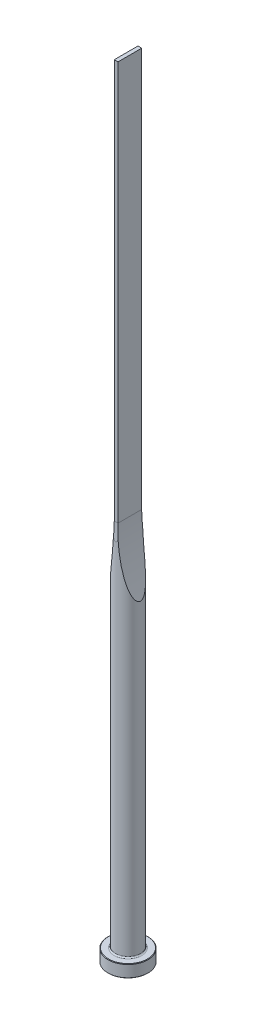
ISO-10303-21;
HEADER;
FILE_DESCRIPTION(('STEP AP214'),'2;1');
FILE_NAME('part.step','',(''),(''),'','','');
FILE_SCHEMA(('AUTOMOTIVE_DESIGN { 1 0 10303 214 1 1 1 1 }'));
ENDSEC;
DATA;
#1=APPLICATION_CONTEXT('core data for automotive mechanical design processes');
#2=APPLICATION_PROTOCOL_DEFINITION('international standard','automotive_design',2000,#1);
#3=PRODUCT_CONTEXT('',#1,'mechanical');
#4=PRODUCT('Part','Part','',(#3));
#5=PRODUCT_RELATED_PRODUCT_CATEGORY('part','',(#4));
#6=PRODUCT_DEFINITION_FORMATION('','',#4);
#7=PRODUCT_DEFINITION_CONTEXT('part definition',#1,'design');
#8=PRODUCT_DEFINITION('design','',#6,#7);
#9=PRODUCT_DEFINITION_SHAPE('','',#8);
#10=(LENGTH_UNIT() NAMED_UNIT(*) SI_UNIT(.MILLI.,.METRE.));
#11=(NAMED_UNIT(*) PLANE_ANGLE_UNIT() SI_UNIT($,.RADIAN.));
#12=(NAMED_UNIT(*) SI_UNIT($,.STERADIAN.) SOLID_ANGLE_UNIT());
#13=UNCERTAINTY_MEASURE_WITH_UNIT(LENGTH_MEASURE(1.E-05),#10,'distance_accuracy_value','');
#14=(GEOMETRIC_REPRESENTATION_CONTEXT(3) GLOBAL_UNCERTAINTY_ASSIGNED_CONTEXT((#13)) GLOBAL_UNIT_ASSIGNED_CONTEXT((#10,
#11,#12)) REPRESENTATION_CONTEXT('',''));
#15=CARTESIAN_POINT('',(0.,0.,0.));
#16=DIRECTION('',(0.,0.,1.));
#17=DIRECTION('',(1.,0.,0.));
#18=AXIS2_PLACEMENT_3D('',#15,#16,#17);
#19=CARTESIAN_POINT('',(0.,0.,0.));
#20=DIRECTION('',(0.,1.,0.));
#21=DIRECTION('',(-1.,0.,0.));
#22=AXIS2_PLACEMENT_3D('',#19,#20,#21);
#23=PLANE('',#22);
#24=CARTESIAN_POINT('',(0.,0.,0.));
#25=DIRECTION('',(0.,1.,0.));
#26=DIRECTION('',(-1.,0.,0.));
#27=AXIS2_PLACEMENT_3D('',#24,#25,#26);
#28=CIRCLE('',#27,7.8);
#29=CARTESIAN_POINT('',(-7.8,0.,0.));
#30=VERTEX_POINT('',#29);
#31=EDGE_CURVE('E133',#30,#30,#28,.T.);
#32=ORIENTED_EDGE('',*,*,#31,.F.);
#33=EDGE_LOOP('',(#32));
#34=FACE_BOUND('',#33,.T.);
#35=ADVANCED_FACE('F32',(#34),#23,.F.);
#36=CARTESIAN_POINT('',(0.,0.,0.));
#37=DIRECTION('',(0.,1.,0.));
#38=DIRECTION('',(-1.,0.,0.));
#39=AXIS2_PLACEMENT_3D('',#36,#37,#38);
#40=CONICAL_SURFACE('',#39,7.8,0.785398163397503);
#41=CARTESIAN_POINT('',(0.,0.199999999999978,0.));
#42=DIRECTION('',(0.,1.,0.));
#43=DIRECTION('',(-1.,0.,0.));
#44=AXIS2_PLACEMENT_3D('',#41,#42,#43);
#45=CIRCLE('',#44,8.);
#46=CARTESIAN_POINT('',(-8.,0.199999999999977,0.));
#47=VERTEX_POINT('',#46);
#48=EDGE_CURVE('E130',#47,#47,#45,.T.);
#49=ORIENTED_EDGE('',*,*,#48,.F.);
#50=EDGE_LOOP('',(#49));
#51=FACE_BOUND('',#50,.T.);
#52=ORIENTED_EDGE('',*,*,#31,.T.);
#53=EDGE_LOOP('',(#52));
#54=FACE_BOUND('',#53,.T.);
#55=ADVANCED_FACE('F171',(#51,#54),#40,.T.);
#56=CARTESIAN_POINT('',(0.,315.,0.));
#57=DIRECTION('',(0.,1.,0.));
#58=DIRECTION('',(-1.,0.,0.));
#59=AXIS2_PLACEMENT_3D('',#56,#57,#58);
#60=CYLINDRICAL_SURFACE('',#59,8.);
#61=CARTESIAN_POINT('',(0.,4.80000000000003,0.));
#62=DIRECTION('',(0.,1.,0.));
#63=DIRECTION('',(-1.,0.,0.));
#64=AXIS2_PLACEMENT_3D('',#61,#62,#63);
#65=CIRCLE('',#64,8.);
#66=CARTESIAN_POINT('',(-8.,4.80000000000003,0.));
#67=VERTEX_POINT('',#66);
#68=EDGE_CURVE('E127',#67,#67,#65,.T.);
#69=ORIENTED_EDGE('',*,*,#68,.F.);
#70=EDGE_LOOP('',(#69));
#71=FACE_BOUND('',#70,.T.);
#72=ORIENTED_EDGE('',*,*,#48,.T.);
#73=EDGE_LOOP('',(#72));
#74=FACE_BOUND('',#73,.T.);
#75=ADVANCED_FACE('F176',(#71,#74),#60,.T.);
#76=CARTESIAN_POINT('',(0.,4.80000000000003,0.));
#77=DIRECTION('',(0.,-1.,0.));
#78=DIRECTION('',(1.,0.,0.));
#79=AXIS2_PLACEMENT_3D('',#76,#77,#78);
#80=CONICAL_SURFACE('',#79,8.,0.785398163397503);
#81=CARTESIAN_POINT('',(0.,5.,0.));
#82=DIRECTION('',(0.,1.,0.));
#83=DIRECTION('',(-1.,0.,0.));
#84=AXIS2_PLACEMENT_3D('',#81,#82,#83);
#85=CIRCLE('',#84,7.8);
#86=CARTESIAN_POINT('',(-7.8,5.,0.));
#87=VERTEX_POINT('',#86);
#88=EDGE_CURVE('E124',#87,#87,#85,.T.);
#89=ORIENTED_EDGE('',*,*,#88,.F.);
#90=EDGE_LOOP('',(#89));
#91=FACE_BOUND('',#90,.T.);
#92=ORIENTED_EDGE('',*,*,#68,.T.);
#93=EDGE_LOOP('',(#92));
#94=FACE_BOUND('',#93,.T.);
#95=ADVANCED_FACE('F183',(#91,#94),#80,.T.);
#96=CARTESIAN_POINT('',(7.8,5.,0.));
#97=DIRECTION('',(0.,-1.,0.));
#98=DIRECTION('',(1.,0.,0.));
#99=AXIS2_PLACEMENT_3D('',#96,#97,#98);
#100=PLANE('',#99);
#101=CARTESIAN_POINT('',(0.,5.,0.));
#102=DIRECTION('',(0.,1.,0.));
#103=DIRECTION('',(-1.,0.,0.));
#104=AXIS2_PLACEMENT_3D('',#101,#102,#103);
#105=CIRCLE('',#104,5.50000000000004);
#106=CARTESIAN_POINT('',(-5.50000000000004,5.,0.));
#107=VERTEX_POINT('',#106);
#108=EDGE_CURVE('E121',#107,#107,#105,.T.);
#109=ORIENTED_EDGE('',*,*,#108,.F.);
#110=EDGE_LOOP('',(#109));
#111=FACE_BOUND('',#110,.T.);
#112=ORIENTED_EDGE('',*,*,#88,.T.);
#113=EDGE_LOOP('',(#112));
#114=FACE_BOUND('',#113,.T.);
#115=ADVANCED_FACE('F190',(#111,#114),#100,.F.);
#116=CARTESIAN_POINT('',(0.,5.5,0.));
#117=DIRECTION('',(0.,1.,0.));
#118=DIRECTION('',(-1.,0.,0.));
#119=AXIS2_PLACEMENT_3D('',#116,#117,#118);
#120=TOROIDAL_SURFACE('',#119,5.50000000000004,0.5);
#121=CARTESIAN_POINT('',(0.,5.50000000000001,0.));
#122=DIRECTION('',(0.,1.,0.));
#123=DIRECTION('',(-1.,0.,0.));
#124=AXIS2_PLACEMENT_3D('',#121,#122,#123);
#125=CIRCLE('',#124,5.00000000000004);
#126=CARTESIAN_POINT('',(-5.00000000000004,5.50000000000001,0.));
#127=VERTEX_POINT('',#126);
#128=EDGE_CURVE('E112',#127,#127,#125,.T.);
#129=ORIENTED_EDGE('',*,*,#128,.F.);
#130=EDGE_LOOP('',(#129));
#131=FACE_BOUND('',#130,.T.);
#132=ORIENTED_EDGE('',*,*,#108,.T.);
#133=EDGE_LOOP('',(#132));
#134=FACE_BOUND('',#133,.T.);
#135=ADVANCED_FACE('F168',(#131,#134),#120,.F.);
#136=CARTESIAN_POINT('',(0.,315.,0.));
#137=DIRECTION('',(0.,1.,0.));
#138=DIRECTION('',(-1.,0.,0.));
#139=AXIS2_PLACEMENT_3D('',#136,#137,#138);
#140=CYLINDRICAL_SURFACE('',#139,5.00000000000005);
#141=CARTESIAN_POINT('',(5.00000000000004,127.669842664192,0.));
#142=CARTESIAN_POINT('',(4.99999699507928,127.669851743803,0.0982088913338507));
#143=CARTESIAN_POINT('',(4.99706880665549,127.6790343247,0.19644965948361));
#144=CARTESIAN_POINT('',(4.98575197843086,127.7145811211,0.389459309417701));
#145=CARTESIAN_POINT('',(4.97735516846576,127.74097104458,0.484222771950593));
#146=CARTESIAN_POINT('',(4.95365028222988,127.815662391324,0.688624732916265));
#147=CARTESIAN_POINT('',(4.93720967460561,127.867566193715,0.796789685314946));
#148=CARTESIAN_POINT('',(4.89948999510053,127.987154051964,1.00302693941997));
#149=CARTESIAN_POINT('',(4.87820124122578,128.054869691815,1.10107846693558));
#150=CARTESIAN_POINT('',(4.8359382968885,128.189960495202,1.27288902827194));
#151=CARTESIAN_POINT('',(4.81543376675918,128.255738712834,1.34805086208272));
#152=CARTESIAN_POINT('',(4.77273910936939,128.393312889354,1.49218520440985));
#153=CARTESIAN_POINT('',(4.75054772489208,128.465113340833,1.56115301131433));
#154=CARTESIAN_POINT('',(4.70492872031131,128.613417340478,1.69368419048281));
#155=CARTESIAN_POINT('',(4.68149855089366,128.689930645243,1.75723565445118));
#156=CARTESIAN_POINT('',(4.63379920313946,128.846479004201,1.87941496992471));
#157=CARTESIAN_POINT('',(4.6095302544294,128.926513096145,1.93804415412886));
#158=CARTESIAN_POINT('',(4.55107793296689,129.12028621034,2.07241841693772));
#159=CARTESIAN_POINT('',(4.51662674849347,129.235291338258,2.14621682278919));
#160=CARTESIAN_POINT('',(4.44705609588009,129.469296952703,2.28688478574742));
#161=CARTESIAN_POINT('',(4.41193633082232,129.588299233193,2.35375117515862));
#162=CARTESIAN_POINT('',(4.34130054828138,129.829531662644,2.48162307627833));
#163=CARTESIAN_POINT('',(4.30578400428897,129.951766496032,2.54261941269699));
#164=CARTESIAN_POINT('',(4.23462595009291,130.198657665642,2.65943766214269));
#165=CARTESIAN_POINT('',(4.19898441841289,130.323314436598,2.71525863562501));
#166=CARTESIAN_POINT('',(4.09180404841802,130.701321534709,2.87644213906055));
#167=CARTESIAN_POINT('',(4.0203282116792,130.957621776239,2.97496635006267));
#168=CARTESIAN_POINT('',(3.91395519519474,131.345838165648,3.11195272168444));
#169=CARTESIAN_POINT('',(3.87865329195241,131.47581215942,3.1557976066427));
#170=CARTESIAN_POINT('',(3.80837436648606,131.736896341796,3.2402641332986));
#171=CARTESIAN_POINT('',(3.77339734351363,131.868006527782,3.2808857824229));
#172=CARTESIAN_POINT('',(3.67901594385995,132.225055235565,3.3871679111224));
#173=CARTESIAN_POINT('',(3.61998329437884,132.451927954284,3.45002099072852));
#174=CARTESIAN_POINT('',(3.50325291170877,132.907907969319,3.56849067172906));
#175=CARTESIAN_POINT('',(3.44555534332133,133.137015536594,3.6241063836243));
#176=CARTESIAN_POINT('',(3.33162157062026,133.597119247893,3.72911556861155));
#177=CARTESIAN_POINT('',(3.27538602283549,133.828116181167,3.77850628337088));
#178=CARTESIAN_POINT('',(3.16450650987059,134.291592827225,3.87183907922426));
#179=CARTESIAN_POINT('',(3.10986263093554,134.524072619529,3.91578086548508));
#180=CARTESIAN_POINT('',(2.94823548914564,135.224261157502,4.04061145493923));
#181=CARTESIAN_POINT('',(2.84377434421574,135.693840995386,4.11431091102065));
#182=CARTESIAN_POINT('',(2.64200093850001,136.636639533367,4.24668601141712));
#183=CARTESIAN_POINT('',(2.5446894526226,137.109858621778,4.30536002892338));
#184=CARTESIAN_POINT('',(2.40413804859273,137.822469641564,4.3844045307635));
#185=CARTESIAN_POINT('',(2.35812547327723,138.060828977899,4.40928874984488));
#186=CARTESIAN_POINT('',(2.26798702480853,138.538154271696,4.45632364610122));
#187=CARTESIAN_POINT('',(2.22386100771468,138.777120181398,4.47847453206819));
#188=CARTESIAN_POINT('',(2.09433007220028,139.494884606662,4.54125653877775));
#189=CARTESIAN_POINT('',(2.01177741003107,139.974523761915,4.57821418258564));
#190=CARTESIAN_POINT('',(1.85448213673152,140.935026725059,4.64415195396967));
#191=CARTESIAN_POINT('',(1.77973040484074,141.415888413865,4.67314146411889));
#192=CARTESIAN_POINT('',(1.63799243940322,142.379101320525,4.72468650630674));
#193=CARTESIAN_POINT('',(1.57100633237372,142.861452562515,4.7472419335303));
#194=CARTESIAN_POINT('',(1.42973388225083,143.943119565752,4.79193069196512));
#195=CARTESIAN_POINT('',(1.35754438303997,144.542767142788,4.81266782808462));
#196=CARTESIAN_POINT('',(1.2252338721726,145.743588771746,4.84803900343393));
#197=CARTESIAN_POINT('',(1.16511336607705,146.344762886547,4.8626727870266));
#198=CARTESIAN_POINT('',(1.0569748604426,147.548395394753,4.88731818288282));
#199=CARTESIAN_POINT('',(1.0089589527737,148.150853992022,4.89732899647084));
#200=CARTESIAN_POINT('',(0.925070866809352,149.356654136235,4.91386505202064));
#201=CARTESIAN_POINT('',(0.889198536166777,149.959995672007,4.92039033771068));
#202=CARTESIAN_POINT('',(0.829566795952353,151.16827043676,4.93079465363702));
#203=CARTESIAN_POINT('',(0.805826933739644,151.773204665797,4.93466941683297));
#204=CARTESIAN_POINT('',(0.770558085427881,152.98344027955,4.94029945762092));
#205=CARTESIAN_POINT('',(0.759029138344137,153.588741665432,4.94205472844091));
#206=CARTESIAN_POINT('',(0.748188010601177,154.799389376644,4.94370758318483));
#207=CARTESIAN_POINT('',(0.748874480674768,155.404735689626,4.94360537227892));
#208=CARTESIAN_POINT('',(0.762460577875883,156.615287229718,4.94152823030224));
#209=CARTESIAN_POINT('',(0.775360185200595,157.220492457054,4.93955330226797));
#210=CARTESIAN_POINT('',(0.813323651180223,158.429137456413,4.93344440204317));
#211=CARTESIAN_POINT('',(0.83835986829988,159.032578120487,4.9293153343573));
#212=CARTESIAN_POINT('',(0.900572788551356,160.238811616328,4.91832972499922));
#213=CARTESIAN_POINT('',(0.937749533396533,160.841604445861,4.9114731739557));
#214=CARTESIAN_POINT('',(1.02423462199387,162.046408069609,4.89416898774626));
#215=CARTESIAN_POINT('',(1.07354573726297,162.648418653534,4.88372053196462));
#216=CARTESIAN_POINT('',(1.18426659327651,163.851222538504,4.85805977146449));
#217=CARTESIAN_POINT('',(1.24567622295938,164.452015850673,4.84284751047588));
#218=CARTESIAN_POINT('',(1.3804154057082,165.650842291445,4.80617538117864));
#219=CARTESIAN_POINT('',(1.45372050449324,166.248878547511,4.78472826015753));
#220=CARTESIAN_POINT('',(1.61227917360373,167.443051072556,4.73365637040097));
#221=CARTESIAN_POINT('',(1.69753323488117,168.039187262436,4.7040312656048));
#222=CARTESIAN_POINT('',(1.87984552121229,169.228758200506,4.63418918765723));
#223=CARTESIAN_POINT('',(1.97689829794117,169.822194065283,4.59397709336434));
#224=CARTESIAN_POINT('',(2.18267352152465,171.005918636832,4.49986490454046));
#225=CARTESIAN_POINT('',(2.29139448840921,171.596207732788,4.4459665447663));
#226=CARTESIAN_POINT('',(2.45986315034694,172.462299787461,4.35348615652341));
#227=CARTESIAN_POINT('',(2.51518571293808,172.739713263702,4.32182626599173));
#228=CARTESIAN_POINT('',(2.62833111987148,173.293477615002,4.25396725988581));
#229=CARTESIAN_POINT('',(2.68615395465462,173.569828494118,4.21776816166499));
#230=CARTESIAN_POINT('',(2.80427875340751,174.121446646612,4.14017109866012));
#231=CARTESIAN_POINT('',(2.86458217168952,174.396713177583,4.09877005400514));
#232=CARTESIAN_POINT('',(2.98755952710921,174.945755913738,4.0100176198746));
#233=CARTESIAN_POINT('',(3.05023343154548,175.21953213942,3.96266631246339));
#234=CARTESIAN_POINT('',(3.17767517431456,175.764537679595,3.86121727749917));
#235=CARTESIAN_POINT('',(3.24243683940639,176.035771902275,3.8071382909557));
#236=CARTESIAN_POINT('',(3.37406891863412,176.576003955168,3.69098491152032));
#237=CARTESIAN_POINT('',(3.44093920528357,176.845001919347,3.62891100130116));
#238=CARTESIAN_POINT('',(3.5765210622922,177.379915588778,3.49536098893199));
#239=CARTESIAN_POINT('',(3.64523082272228,177.645833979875,3.42389387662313));
#240=CARTESIAN_POINT('',(3.78423448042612,178.173910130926,3.26961382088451));
#241=CARTESIAN_POINT('',(3.85452797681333,178.436068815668,3.18680372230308));
#242=CARTESIAN_POINT('',(3.98084744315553,178.898924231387,3.02669103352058));
#243=CARTESIAN_POINT('',(4.0366587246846,179.1006111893,2.95209405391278));
#244=CARTESIAN_POINT('',(4.14863367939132,179.499925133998,2.79255461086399));
#245=CARTESIAN_POINT('',(4.20479751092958,179.697550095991,2.70760712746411));
#246=CARTESIAN_POINT('',(4.31689598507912,180.087040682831,2.52505376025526));
#247=CARTESIAN_POINT('',(4.37283057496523,180.278905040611,2.42744511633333));
#248=CARTESIAN_POINT('',(4.48350393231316,180.654038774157,2.2164044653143));
#249=CARTESIAN_POINT('',(4.53824401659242,180.837317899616,2.1029910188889));
#250=CARTESIAN_POINT('',(4.61847515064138,181.103049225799,1.916838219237));
#251=CARTESIAN_POINT('',(4.64503859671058,181.1905248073,1.85173475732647));
#252=CARTESIAN_POINT('',(4.69706434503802,181.360959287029,1.71549282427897));
#253=CARTESIAN_POINT('',(4.72252723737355,181.443920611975,1.64435764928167));
#254=CARTESIAN_POINT('',(4.77174387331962,181.603503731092,1.49551754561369));
#255=CARTESIAN_POINT('',(4.79550570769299,181.680155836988,1.41784815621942));
#256=CARTESIAN_POINT('',(4.84072891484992,181.825415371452,1.25478768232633));
#257=CARTESIAN_POINT('',(4.86219348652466,181.894033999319,1.16940764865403));
#258=CARTESIAN_POINT('',(4.89983178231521,182.013925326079,0.999221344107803));
#259=CARTESIAN_POINT('',(4.91632155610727,182.066252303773,0.915239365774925));
#260=CARTESIAN_POINT('',(4.94568332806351,182.159190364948,0.740314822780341));
#261=CARTESIAN_POINT('',(4.95855605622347,182.199803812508,0.649373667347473));
#262=CARTESIAN_POINT('',(4.97967235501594,182.266318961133,0.46040854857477));
#263=CARTESIAN_POINT('',(4.98786140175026,182.292047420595,0.362315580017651));
#264=CARTESIAN_POINT('',(4.99834260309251,182.324962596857,0.162784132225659));
#265=CARTESIAN_POINT('',(5.00064333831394,182.332176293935,0.0613507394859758));
#266=CARTESIAN_POINT('',(4.99912871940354,182.327423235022,-0.129738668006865));
#267=CARTESIAN_POINT('',(4.99596097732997,182.317487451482,-0.219457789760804));
#268=CARTESIAN_POINT('',(4.98509069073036,182.283340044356,-0.395853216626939));
#269=CARTESIAN_POINT('',(4.97738412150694,182.259115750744,-0.482526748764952));
#270=CARTESIAN_POINT('',(4.95515693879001,182.189090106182,-0.67735860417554));
#271=CARTESIAN_POINT('',(4.93925948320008,182.138911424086,-0.783765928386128));
#272=CARTESIAN_POINT('',(4.90272769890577,182.023129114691,-0.98690868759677));
#273=CARTESIAN_POINT('',(4.88208302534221,181.957491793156,-1.08362232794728));
#274=CARTESIAN_POINT('',(4.84100760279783,181.826274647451,-1.25341133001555));
#275=CARTESIAN_POINT('',(4.82103631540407,181.762251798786,-1.32783051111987));
#276=CARTESIAN_POINT('',(4.77941264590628,181.628237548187,-1.47062973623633));
#277=CARTESIAN_POINT('',(4.75775900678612,181.558241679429,-1.53900518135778));
#278=CARTESIAN_POINT('',(4.71321084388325,181.413569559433,-1.67046986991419));
#279=CARTESIAN_POINT('',(4.69031369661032,181.33888335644,-1.73354716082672));
#280=CARTESIAN_POINT('',(4.64367110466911,181.18599846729,-1.85486860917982));
#281=CARTESIAN_POINT('',(4.61992588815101,181.107800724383,-1.91311405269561));
#282=CARTESIAN_POINT('',(4.56303275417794,180.919482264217,-2.04589785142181));
#283=CARTESIAN_POINT('',(4.52962317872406,180.80814935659,-2.11860066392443));
#284=CARTESIAN_POINT('',(4.46212127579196,180.581555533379,-2.25730286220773));
#285=CARTESIAN_POINT('',(4.42802864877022,180.466292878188,-2.32329922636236));
#286=CARTESIAN_POINT('',(4.35942592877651,180.232589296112,-2.44960786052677));
#287=CARTESIAN_POINT('',(4.32491528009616,180.114143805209,-2.50991133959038));
#288=CARTESIAN_POINT('',(4.25574061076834,179.874859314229,-2.62548976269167));
#289=CARTESIAN_POINT('',(4.22107656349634,179.754019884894,-2.68076379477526));
#290=CARTESIAN_POINT('',(4.11679730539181,179.387553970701,-2.84047005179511));
#291=CARTESIAN_POINT('',(4.0471969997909,179.139007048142,-2.93824759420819));
#292=CARTESIAN_POINT('',(3.94352939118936,178.76244211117,-3.07437538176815));
#293=CARTESIAN_POINT('',(3.90911066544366,178.636352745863,-3.11797799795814));
#294=CARTESIAN_POINT('',(3.840562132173,178.383045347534,-3.20203557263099));
#295=CARTESIAN_POINT('',(3.80643232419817,178.255827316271,-3.24249053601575));
#296=CARTESIAN_POINT('',(3.7146788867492,177.910771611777,-3.34797324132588));
#297=CARTESIAN_POINT('',(3.65738498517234,177.692023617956,-3.41031063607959));
#298=CARTESIAN_POINT('',(3.5440061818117,177.252330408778,-3.52798636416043));
#299=CARTESIAN_POINT('',(3.48792142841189,177.031384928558,-3.58332384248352));
#300=CARTESIAN_POINT('',(3.37708493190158,176.587636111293,-3.68796817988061));
#301=CARTESIAN_POINT('',(3.32233378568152,176.364832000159,-3.7372723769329));
#302=CARTESIAN_POINT('',(3.21429209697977,175.917761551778,-3.8305887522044));
#303=CARTESIAN_POINT('',(3.16100163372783,175.693495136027,-3.87460064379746));
#304=CARTESIAN_POINT('',(3.00324290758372,175.018008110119,-3.99983204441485));
#305=CARTESIAN_POINT('',(2.90109756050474,174.564940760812,-4.07405450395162));
#306=CARTESIAN_POINT('',(2.70342192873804,173.655210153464,-4.20781492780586));
#307=CARTESIAN_POINT('',(2.60789236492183,173.198546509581,-4.26735129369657));
#308=CARTESIAN_POINT('',(2.46960125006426,172.510743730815,-4.34786272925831));
#309=CARTESIAN_POINT('',(2.42426738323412,172.280625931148,-4.37326900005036));
#310=CARTESIAN_POINT('',(2.33535330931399,171.819789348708,-4.4213890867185));
#311=CARTESIAN_POINT('',(2.29177296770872,171.589070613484,-4.44410310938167));
#312=CARTESIAN_POINT('',(2.16367988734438,170.896056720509,-4.50861966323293));
#313=CARTESIAN_POINT('',(2.08182015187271,170.432929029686,-4.54679379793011));
#314=CARTESIAN_POINT('',(1.92537933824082,169.505437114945,-4.6152121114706));
#315=CARTESIAN_POINT('',(1.85078986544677,169.041074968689,-4.64546550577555));
#316=CARTESIAN_POINT('',(1.7088496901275,168.110870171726,-4.69953135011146));
#317=CARTESIAN_POINT('',(1.64149909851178,167.645027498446,-4.72334370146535));
#318=CARTESIAN_POINT('',(1.49589073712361,166.578873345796,-4.77176871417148));
#319=CARTESIAN_POINT('',(1.42001220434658,165.978158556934,-4.7946673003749));
#320=CARTESIAN_POINT('',(1.28037168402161,164.775088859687,-4.83382826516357));
#321=CARTESIAN_POINT('',(1.21661025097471,164.172733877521,-4.85009034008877));
#322=CARTESIAN_POINT('',(1.10124220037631,162.966636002,-4.87757947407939));
#323=CARTESIAN_POINT('',(1.04963784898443,162.36289287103,-4.88880559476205));
#324=CARTESIAN_POINT('',(0.958630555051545,161.154440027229,-4.90746196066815));
#325=CARTESIAN_POINT('',(0.919227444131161,160.549730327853,-4.91489225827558));
#326=CARTESIAN_POINT('',(0.852590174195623,159.338669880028,-4.92688920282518));
#327=CARTESIAN_POINT('',(0.825375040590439,158.732318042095,-4.93145137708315));
#328=CARTESIAN_POINT('',(0.783216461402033,157.519173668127,-4.93832234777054));
#329=CARTESIAN_POINT('',(0.768273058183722,156.912381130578,-4.94063113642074));
#330=CARTESIAN_POINT('',(0.750665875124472,155.698683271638,-4.94333691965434));
#331=CARTESIAN_POINT('',(0.748000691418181,155.091777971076,-4.94373413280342));
#332=CARTESIAN_POINT('',(0.754947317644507,153.878040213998,-4.94267812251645));
#333=CARTESIAN_POINT('',(0.76455910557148,153.271207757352,-4.94122490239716));
#334=CARTESIAN_POINT('',(0.795991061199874,152.06034497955,-4.93625874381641));
#335=CARTESIAN_POINT('',(0.817761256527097,151.456313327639,-4.93275423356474));
#336=CARTESIAN_POINT('',(0.873464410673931,150.248828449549,-4.92319603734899));
#337=CARTESIAN_POINT('',(0.907397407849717,149.645375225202,-4.9171423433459));
#338=CARTESIAN_POINT('',(0.987417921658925,148.439187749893,-4.90170050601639));
#339=CARTESIAN_POINT('',(1.03350801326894,147.836453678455,-4.89231165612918));
#340=CARTESIAN_POINT('',(1.13781360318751,146.63212303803,-4.86911049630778));
#341=CARTESIAN_POINT('',(1.19602899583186,146.030526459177,-4.8552982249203));
#342=CARTESIAN_POINT('',(1.32443333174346,144.829852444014,-4.82185371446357));
#343=CARTESIAN_POINT('',(1.39460080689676,144.230772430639,-4.80223186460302));
#344=CARTESIAN_POINT('',(1.54692746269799,143.034404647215,-4.75535211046));
#345=CARTESIAN_POINT('',(1.62908710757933,142.437116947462,-4.72809391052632));
#346=CARTESIAN_POINT('',(1.80526862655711,141.245088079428,-4.66366847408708));
#347=CARTESIAN_POINT('',(1.89928532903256,140.650345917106,-4.6265055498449));
#348=CARTESIAN_POINT('',(2.09906338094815,139.463808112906,-4.53936634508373));
#349=CARTESIAN_POINT('',(2.20482329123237,138.872012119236,-4.48939163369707));
#350=CARTESIAN_POINT('',(2.34532227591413,138.128801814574,-4.41593936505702));
#351=CARTESIAN_POINT('',(2.37470006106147,137.975585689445,-4.40022149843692));
#352=CARTESIAN_POINT('',(2.43422691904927,137.66943337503,-4.36757305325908));
#353=CARTESIAN_POINT('',(2.46437598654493,137.516497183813,-4.35064248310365));
#354=CARTESIAN_POINT('',(2.55597254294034,137.058132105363,-4.29790342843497));
#355=CARTESIAN_POINT('',(2.61856824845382,136.753152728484,-4.26014818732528));
#356=CARTESIAN_POINT('',(2.74669084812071,136.144919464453,-4.17869028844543));
#357=CARTESIAN_POINT('',(2.81221479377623,135.841664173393,-4.13499352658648));
#358=CARTESIAN_POINT('',(2.94615340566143,135.236891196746,-4.04065297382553));
#359=CARTESIAN_POINT('',(3.014567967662,134.935373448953,-3.99000943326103));
#360=CARTESIAN_POINT('',(3.18170490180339,134.215906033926,-3.85903385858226));
#361=CARTESIAN_POINT('',(3.28173935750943,133.798933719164,-3.77487006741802));
#362=CARTESIAN_POINT('',(3.43548586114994,133.177504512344,-3.63349010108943));
#363=CARTESIAN_POINT('',(3.48739125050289,132.970877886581,-3.58379764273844));
#364=CARTESIAN_POINT('',(3.59230596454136,132.559379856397,-3.47863022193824));
#365=CARTESIAN_POINT('',(3.64531525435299,132.354508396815,-3.42315544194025));
#366=CARTESIAN_POINT('',(3.75469886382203,131.937778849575,-3.30289868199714));
#367=CARTESIAN_POINT('',(3.81111740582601,131.726020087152,-3.23781064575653));
#368=CARTESIAN_POINT('',(3.92476947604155,131.30555443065,-3.09906983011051));
#369=CARTESIAN_POINT('',(3.9820029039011,131.096847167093,-3.0254180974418));
#370=CARTESIAN_POINT('',(4.09681892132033,130.683914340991,-2.86802214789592));
#371=CARTESIAN_POINT('',(4.15440042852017,130.479679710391,-2.78430113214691));
#372=CARTESIAN_POINT('',(4.26949135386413,130.076809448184,-2.60439511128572));
#373=CARTESIAN_POINT('',(4.32700079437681,129.878170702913,-2.50821721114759));
#374=CARTESIAN_POINT('',(4.43028324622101,129.525826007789,-2.3198762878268));
#375=CARTESIAN_POINT('',(4.47621505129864,129.370738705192,-2.2304064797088));
#376=CARTESIAN_POINT('',(4.56679022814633,129.067793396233,-2.03855775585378));
#377=CARTESIAN_POINT('',(4.6114311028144,128.91994906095,-1.93615564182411));
#378=CARTESIAN_POINT('',(4.69845402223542,128.634228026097,-1.71432946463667));
#379=CARTESIAN_POINT('',(4.74080961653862,128.496463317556,-1.59474829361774));
#380=CARTESIAN_POINT('',(4.82032680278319,128.239785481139,-1.33521257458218));
#381=CARTESIAN_POINT('',(4.85750638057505,128.120806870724,-1.19533221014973));
#382=CARTESIAN_POINT('',(4.90769951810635,127.961082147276,-0.960061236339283));
#383=CARTESIAN_POINT('',(4.92405693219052,127.909230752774,-0.872993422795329));
#384=CARTESIAN_POINT('',(4.95276787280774,127.818439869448,-0.691721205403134));
#385=CARTESIAN_POINT('',(4.96512753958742,127.779480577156,-0.597528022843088));
#386=CARTESIAN_POINT('',(4.98299962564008,127.723226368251,-0.419843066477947));
#387=CARTESIAN_POINT('',(4.98931861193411,127.703375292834,-0.337252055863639));
#388=CARTESIAN_POINT('',(4.99781898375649,127.676683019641,-0.169781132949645));
#389=CARTESIAN_POINT('',(5.00000259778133,127.669834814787,-0.0849024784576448));
#390=CARTESIAN_POINT('',(5.00000000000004,127.669842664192,0.));
#391=B_SPLINE_CURVE_WITH_KNOTS('',3,(#141,#142,#143,#144,#145,#146,#147,#148,#149,#150,#151,
#152,#153,#154,#155,#156,#157,#158,#159,#160,#161,#162,#163,#164,#165,#166,#167,#168,#169,#170,
#171,#172,#173,#174,#175,#176,#177,#178,#179,#180,#181,#182,#183,#184,#185,#186,#187,#188,#189,
#190,#191,#192,#193,#194,#195,#196,#197,#198,#199,#200,#201,#202,#203,#204,#205,#206,#207,#208,
#209,#210,#211,#212,#213,#214,#215,#216,#217,#218,#219,#220,#221,#222,#223,#224,#225,#226,#227,
#228,#229,#230,#231,#232,#233,#234,#235,#236,#237,#238,#239,#240,#241,#242,#243,#244,#245,#246,
#247,#248,#249,#250,#251,#252,#253,#254,#255,#256,#257,#258,#259,#260,#261,#262,#263,#264,#265,
#266,#267,#268,#269,#270,#271,#272,#273,#274,#275,#276,#277,#278,#279,#280,#281,#282,#283,#284,
#285,#286,#287,#288,#289,#290,#291,#292,#293,#294,#295,#296,#297,#298,#299,#300,#301,#302,#303,
#304,#305,#306,#307,#308,#309,#310,#311,#312,#313,#314,#315,#316,#317,#318,#319,#320,#321,#322,
#323,#324,#325,#326,#327,#328,#329,#330,#331,#332,#333,#334,#335,#336,#337,#338,#339,#340,#341,
#342,#343,#344,#345,#346,#347,#348,#349,#350,#351,#352,#353,#354,#355,#356,#357,#358,#359,#360,
#361,#362,#363,#364,#365,#366,#367,#368,#369,#370,#371,#372,#373,#374,#375,#376,#377,#378,#379,
#380,#381,#382,#383,#384,#385,#386,#387,#388,#389,#390),.UNSPECIFIED.,.T.,.F.,(4,2,2,2,2,2,2,2,
2,2,2,2,2,2,2,2,2,2,2,2,2,2,2,2,2,2,2,2,2,2,2,2,2,2,2,2,2,2,2,2,2,2,2,2,2,2,2,2,2,2,2,2,2,2,2,2,
2,2,2,2,2,2,2,2,2,2,2,2,2,2,2,2,2,2,2,2,2,2,2,2,2,2,2,2,2,2,2,2,2,2,2,2,2,2,2,2,2,2,2,2,2,2,2,2,
2,2,2,2,2,2,2,2,2,2,2,2,2,2,2,2,2,2,2,2,4),(0.,0.294245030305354,0.588930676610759,
0.950164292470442,1.31212573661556,1.61758407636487,1.92327235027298,2.22961624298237,
2.53587692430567,2.95834524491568,3.38100577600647,3.80431657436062,4.22770407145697,
5.07825920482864,5.50315578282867,5.92805138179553,6.65601763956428,7.38407328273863,
8.11245040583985,8.84086692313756,10.3004734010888,11.7602378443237,12.492313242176,
13.2243326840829,14.6884516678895,16.1508391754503,17.6132505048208,19.4260810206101,
21.2389874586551,23.0522069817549,24.8654037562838,26.6815127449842,28.4976275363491,
30.3135417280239,32.1294529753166,33.9412477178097,35.7530486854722,37.5652638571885,
39.3774623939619,41.185981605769,42.9945751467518,44.8023366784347,46.6098691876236,
47.4637565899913,48.317640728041,49.1720328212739,50.0264131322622,50.8784645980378,
51.7304646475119,52.5816551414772,53.4326325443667,54.0989116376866,54.7655151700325,
55.4322642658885,56.0982368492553,56.4347350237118,56.7710504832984,57.1056422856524,
57.4397619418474,57.7399102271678,58.0399978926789,58.3435113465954,58.6465822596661,
58.916170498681,59.1859981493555,59.5401534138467,59.8950878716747,60.1952011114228,
60.4955407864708,60.796540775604,61.0974603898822,61.5084756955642,61.9196753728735,
62.3314999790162,62.7433991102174,63.5707846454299,63.984113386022,64.3974414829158,
65.1009780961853,65.8046005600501,66.5085323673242,67.2125022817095,68.6231039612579,
70.0338591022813,70.7415778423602,71.4492421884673,72.8646483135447,74.27840027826,
75.6921739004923,77.5097580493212,79.3274253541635,81.1454312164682,82.9634119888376,
84.7842208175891,86.6050359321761,88.4256428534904,90.2462465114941,92.0594217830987,
93.8726027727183,95.6861681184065,97.4997176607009,99.3100434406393,101.12043931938,
102.930048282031,104.739435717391,105.209821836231,105.680204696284,106.620988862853,
107.560846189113,108.50066965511,109.811133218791,110.467360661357,111.123567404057,
111.809237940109,112.494824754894,113.178861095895,113.862508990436,114.416600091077,
114.971699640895,115.532243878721,116.090788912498,116.397869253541,116.704475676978,
116.958990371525,117.213367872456),.UNSPECIFIED.);
#392=CARTESIAN_POINT('',(0.915475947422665,149.544884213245,-4.9154759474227));
#393=VERTEX_POINT('',#392);
#394=CARTESIAN_POINT('',(0.91547594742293,149.544884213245,4.91547594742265));
#395=VERTEX_POINT('',#394);
#396=EDGE_CURVE('E138',#393,#395,#391,.T.);
#397=ORIENTED_EDGE('',*,*,#396,.T.);
#398=CARTESIAN_POINT('',(-1.56124949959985,155.,4.74999999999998));
#399=CARTESIAN_POINT('',(-1.56124909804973,155.280275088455,4.74999999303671));
#400=CARTESIAN_POINT('',(-1.55728190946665,155.560549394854,4.75130959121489));
#401=CARTESIAN_POINT('',(-1.54122236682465,156.120839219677,4.75654354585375));
#402=CARTESIAN_POINT('',(-1.52913016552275,156.400854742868,4.76046785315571));
#403=CARTESIAN_POINT('',(-1.49622334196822,156.960158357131,4.7709137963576));
#404=CARTESIAN_POINT('',(-1.47541419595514,157.239446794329,4.77743380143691));
#405=CARTESIAN_POINT('',(-1.42390023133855,157.796993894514,4.79304036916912));
#406=CARTESIAN_POINT('',(-1.39319740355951,158.07525275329,4.80212641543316));
#407=CARTESIAN_POINT('',(-1.3216385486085,158.616514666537,4.82230425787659));
#408=CARTESIAN_POINT('',(-1.281355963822,158.879595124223,4.83327546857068));
#409=CARTESIAN_POINT('',(-1.21025315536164,159.272594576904,4.85137807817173));
#410=CARTESIAN_POINT('',(-1.18472794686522,159.403511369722,4.85769686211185));
#411=CARTESIAN_POINT('',(-1.129414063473,159.664393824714,4.87085630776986));
#412=CARTESIAN_POINT('',(-1.09962649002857,159.794359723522,4.87769683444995));
#413=CARTESIAN_POINT('',(-1.04028074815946,160.030993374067,4.89066177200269));
#414=CARTESIAN_POINT('',(-1.01154252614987,160.137869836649,4.89671054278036));
#415=CARTESIAN_POINT('',(-0.94955690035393,160.350283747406,4.9091085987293));
#416=CARTESIAN_POINT('',(-0.916310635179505,160.455821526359,4.91545780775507));
#417=CARTESIAN_POINT('',(-0.844084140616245,160.664473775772,4.92837326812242));
#418=CARTESIAN_POINT('',(-0.805125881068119,160.7675958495,4.93493861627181));
#419=CARTESIAN_POINT('',(-0.719242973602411,160.9704088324,4.94819344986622));
#420=CARTESIAN_POINT('',(-0.672333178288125,161.070105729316,4.95488268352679));
#421=CARTESIAN_POINT('',(-0.590193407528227,161.21931421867,4.96512953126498));
#422=CARTESIAN_POINT('',(-0.559251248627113,161.271162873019,4.96873759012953));
#423=CARTESIAN_POINT('',(-0.492379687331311,161.371634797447,4.97581229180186));
#424=CARTESIAN_POINT('',(-0.45645383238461,161.420260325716,4.97927903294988));
#425=CARTESIAN_POINT('',(-0.392115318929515,161.495011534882,4.98466324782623));
#426=CARTESIAN_POINT('',(-0.365747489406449,161.522870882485,4.98668429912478));
#427=CARTESIAN_POINT('',(-0.309588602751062,161.574972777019,4.9904856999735));
#428=CARTESIAN_POINT('',(-0.279803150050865,161.599221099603,4.99226643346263));
#429=CARTESIAN_POINT('',(-0.226668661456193,161.634995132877,4.99490514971));
#430=CARTESIAN_POINT('',(-0.204394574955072,161.648089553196,4.99587455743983));
#431=CARTESIAN_POINT('',(-0.158090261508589,161.670718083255,4.99755352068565));
#432=CARTESIAN_POINT('',(-0.134063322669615,161.680258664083,4.99826354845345));
#433=CARTESIAN_POINT('',(-0.0886514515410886,161.69358980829,4.9992568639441));
#434=CARTESIAN_POINT('',(-0.0674708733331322,161.698062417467,4.99959071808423));
#435=CARTESIAN_POINT('',(-0.0246551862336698,161.703342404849,4.99998491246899));
#436=CARTESIAN_POINT('',(-0.00302040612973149,161.704152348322,5.00004544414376));
#437=CARTESIAN_POINT('',(0.0400515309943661,161.702017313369,4.99988599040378));
#438=CARTESIAN_POINT('',(0.0614887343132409,161.699073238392,4.99966607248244));
#439=CARTESIAN_POINT('',(0.103598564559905,161.689756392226,4.9989711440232));
#440=CARTESIAN_POINT('',(0.124270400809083,161.683380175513,4.99849587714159));
#441=CARTESIAN_POINT('',(0.172649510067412,161.664591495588,4.99709843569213));
#442=CARTESIAN_POINT('',(0.199804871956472,161.650779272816,4.9960731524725));
#443=CARTESIAN_POINT('',(0.251622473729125,161.619113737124,4.9937323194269));
#444=CARTESIAN_POINT('',(0.276277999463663,161.601249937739,4.99241601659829));
#445=CARTESIAN_POINT('',(0.342266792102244,161.547223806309,4.98845446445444));
#446=CARTESIAN_POINT('',(0.38098991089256,161.507933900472,4.98559441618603));
#447=CARTESIAN_POINT('',(0.45275953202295,161.424556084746,4.97958806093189));
#448=CARTESIAN_POINT('',(0.48578793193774,161.380453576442,4.97644088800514));
#449=CARTESIAN_POINT('',(0.565503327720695,161.263121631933,4.96816187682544));
#450=CARTESIAN_POINT('',(0.609051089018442,161.187790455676,4.96293429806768));
#451=CARTESIAN_POINT('',(0.689220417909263,161.033476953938,4.95243210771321));
#452=CARTESIAN_POINT('',(0.725825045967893,160.954486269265,4.94715741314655));
#453=CARTESIAN_POINT('',(0.794127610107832,160.79392156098,4.9366548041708));
#454=CARTESIAN_POINT('',(0.825798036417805,160.712335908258,4.93142729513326));
#455=CARTESIAN_POINT('',(0.885154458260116,160.547854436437,4.92111763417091));
#456=CARTESIAN_POINT('',(0.912845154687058,160.464960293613,4.91603531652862));
#457=CARTESIAN_POINT('',(0.991561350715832,160.213800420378,4.90099061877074));
#458=CARTESIAN_POINT('',(1.03784195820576,160.04403532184,4.89129471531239));
#459=CARTESIAN_POINT('',(1.12160376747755,159.70227259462,4.87276151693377));
#460=CARTESIAN_POINT('',(1.15907938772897,159.530273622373,4.86392476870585));
#461=CARTESIAN_POINT('',(1.22728467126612,159.184529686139,4.84716510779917));
#462=CARTESIAN_POINT('',(1.25799984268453,159.010781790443,4.83924417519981));
#463=CARTESIAN_POINT('',(1.31385289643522,158.662342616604,4.82437696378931));
#464=CARTESIAN_POINT('',(1.33899000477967,158.487651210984,4.81743082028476));
#465=CARTESIAN_POINT('',(1.4073415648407,157.962576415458,4.79809189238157));
#466=CARTESIAN_POINT('',(1.44349272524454,157.611211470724,4.78719953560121));
#467=CARTESIAN_POINT('',(1.50080391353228,156.907652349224,4.76953198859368));
#468=CARTESIAN_POINT('',(1.52198194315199,156.555459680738,4.76275185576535));
#469=CARTESIAN_POINT('',(1.55100340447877,155.854340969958,4.75337976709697));
#470=CARTESIAN_POINT('',(1.5589903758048,155.505421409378,4.75074274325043));
#471=CARTESIAN_POINT('',(1.56268162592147,154.807374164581,4.74952903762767));
#472=CARTESIAN_POINT('',(1.5583809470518,154.458246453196,4.75095399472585));
#473=CARTESIAN_POINT('',(1.53718974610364,153.761012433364,4.75785466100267));
#474=CARTESIAN_POINT('',(1.52032131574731,153.412905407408,4.76332326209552));
#475=CARTESIAN_POINT('',(1.47267594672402,152.717832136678,4.77826818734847));
#476=CARTESIAN_POINT('',(1.44190352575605,152.370865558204,4.78774320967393));
#477=CARTESIAN_POINT('',(1.3636539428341,151.678826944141,4.81063411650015));
#478=CARTESIAN_POINT('',(1.31617630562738,151.333754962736,4.82405011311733));
#479=CARTESIAN_POINT('',(1.2278246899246,150.819245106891,4.84699228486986));
#480=CARTESIAN_POINT('',(1.19552315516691,150.64827833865,4.855108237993));
#481=CARTESIAN_POINT('',(1.12372438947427,150.307953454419,4.87222905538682));
#482=CARTESIAN_POINT('',(1.08422969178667,150.138594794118,4.88123360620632));
#483=CARTESIAN_POINT('',(0.99570217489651,149.802088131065,4.9000691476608));
#484=CARTESIAN_POINT('',(0.946657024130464,149.634943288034,4.9099011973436));
#485=CARTESIAN_POINT('',(0.862537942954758,149.387690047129,4.92512126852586));
#486=CARTESIAN_POINT('',(0.832712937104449,149.305788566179,4.93027740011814));
#487=CARTESIAN_POINT('',(0.768517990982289,149.143809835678,4.94069314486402));
#488=CARTESIAN_POINT('',(0.7341510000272,149.063731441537,4.94595268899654));
#489=CARTESIAN_POINT('',(0.65907479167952,148.905998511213,4.95651780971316));
#490=CARTESIAN_POINT('',(0.618328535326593,148.828361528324,4.96182347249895));
#491=CARTESIAN_POINT('',(0.528037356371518,148.678498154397,4.97225145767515));
#492=CARTESIAN_POINT('',(0.478541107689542,148.606244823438,4.97737461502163));
#493=CARTESIAN_POINT('',(0.401827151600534,148.51602270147,4.98386702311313));
#494=CARTESIAN_POINT('',(0.38068696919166,148.492964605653,4.9855360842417));
#495=CARTESIAN_POINT('',(0.336184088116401,148.448977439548,4.98873561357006));
#496=CARTESIAN_POINT('',(0.312817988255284,148.428051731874,4.99026586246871));
#497=CARTESIAN_POINT('',(0.263265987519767,148.389093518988,4.99312671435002));
#498=CARTESIAN_POINT('',(0.237049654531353,148.37109868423,4.99445470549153));
#499=CARTESIAN_POINT('',(0.181897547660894,148.33988275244,4.99676560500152));
#500=CARTESIAN_POINT('',(0.152971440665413,148.326645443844,4.99774968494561));
#501=CARTESIAN_POINT('',(0.10229806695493,148.309907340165,4.9989960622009));
#502=CARTESIAN_POINT('',(0.0811370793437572,148.304655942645,4.99938786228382));
#503=CARTESIAN_POINT('',(0.0382302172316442,148.297798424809,4.99989968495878));
#504=CARTESIAN_POINT('',(0.0164849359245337,148.296188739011,5.00001997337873));
#505=CARTESIAN_POINT('',(-0.0269727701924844,148.296797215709,4.9999745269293));
#506=CARTESIAN_POINT('',(-0.0486851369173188,148.299019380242,4.9998084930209));
#507=CARTESIAN_POINT('',(-0.0914351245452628,148.307043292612,4.99920977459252));
#508=CARTESIAN_POINT('',(-0.112472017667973,148.312848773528,4.99877681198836));
#509=CARTESIAN_POINT('',(-0.160507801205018,148.330016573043,4.99749910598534));
#510=CARTESIAN_POINT('',(-0.187061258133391,148.342604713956,4.99656385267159));
#511=CARTESIAN_POINT('',(-0.237848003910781,148.371778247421,4.9944046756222));
#512=CARTESIAN_POINT('',(-0.262075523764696,148.388373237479,4.99318005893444));
#513=CARTESIAN_POINT('',(-0.325987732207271,148.438060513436,4.98953016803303));
#514=CARTESIAN_POINT('',(-0.363355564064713,148.474076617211,4.98690191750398));
#515=CARTESIAN_POINT('',(-0.43279234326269,148.550821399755,4.98135512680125));
#516=CARTESIAN_POINT('',(-0.464844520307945,148.59156432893,4.97843571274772));
#517=CARTESIAN_POINT('',(-0.54098254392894,148.698328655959,4.97086484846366));
#518=CARTESIAN_POINT('',(-0.582371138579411,148.766244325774,4.96611994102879));
#519=CARTESIAN_POINT('',(-0.658822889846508,148.905593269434,4.95655294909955));
#520=CARTESIAN_POINT('',(-0.69387090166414,148.977034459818,4.95173070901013));
#521=CARTESIAN_POINT('',(-0.759457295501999,149.122416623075,4.94209752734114));
#522=CARTESIAN_POINT('',(-0.789969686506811,149.196369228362,4.9372867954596));
#523=CARTESIAN_POINT('',(-0.847303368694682,149.345575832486,4.9277695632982));
#524=CARTESIAN_POINT('',(-0.874128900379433,149.420828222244,4.923062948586));
#525=CARTESIAN_POINT('',(-0.949689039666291,149.646319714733,4.90924878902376));
#526=CARTESIAN_POINT('',(-0.994217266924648,149.797976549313,4.9003350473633));
#527=CARTESIAN_POINT('',(-1.07533721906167,150.103461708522,4.88316862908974));
#528=CARTESIAN_POINT('',(-1.11192387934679,150.257291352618,4.87491637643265));
#529=CARTESIAN_POINT('',(-1.17902124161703,150.566637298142,4.85912545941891));
#530=CARTESIAN_POINT('',(-1.20951893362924,150.722156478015,4.85158834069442));
#531=CARTESIAN_POINT('',(-1.26550324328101,151.034136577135,4.83728492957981));
#532=CARTESIAN_POINT('',(-1.29098915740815,151.190597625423,4.83051874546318));
#533=CARTESIAN_POINT('',(-1.36110123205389,151.660730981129,4.81142337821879));
#534=CARTESIAN_POINT('',(-1.39943115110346,151.975395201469,4.80028500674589));
#535=CARTESIAN_POINT('',(-1.46294686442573,152.605717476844,4.78130109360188));
#536=CARTESIAN_POINT('',(-1.48814772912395,152.921373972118,4.77345177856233));
#537=CARTESIAN_POINT('',(-1.52589501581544,153.530876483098,4.76151277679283));
#538=CARTESIAN_POINT('',(-1.53921639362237,153.8246708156,4.757194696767));
#539=CARTESIAN_POINT('',(-1.55689016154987,154.412310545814,4.75143949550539));
#540=CARTESIAN_POINT('',(-1.56124992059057,154.706155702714,4.75000000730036));
#541=CARTESIAN_POINT('',(-1.56124949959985,155.,4.74999999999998));
#542=B_SPLINE_CURVE_WITH_KNOTS('',3,(#398,#399,#400,#401,#402,#403,#404,#405,#406,#407,#408,
#409,#410,#411,#412,#413,#414,#415,#416,#417,#418,#419,#420,#421,#422,#423,#424,#425,#426,#427,
#428,#429,#430,#431,#432,#433,#434,#435,#436,#437,#438,#439,#440,#441,#442,#443,#444,#445,#446,
#447,#448,#449,#450,#451,#452,#453,#454,#455,#456,#457,#458,#459,#460,#461,#462,#463,#464,#465,
#466,#467,#468,#469,#470,#471,#472,#473,#474,#475,#476,#477,#478,#479,#480,#481,#482,#483,#484,
#485,#486,#487,#488,#489,#490,#491,#492,#493,#494,#495,#496,#497,#498,#499,#500,#501,#502,#503,
#504,#505,#506,#507,#508,#509,#510,#511,#512,#513,#514,#515,#516,#517,#518,#519,#520,#521,#522,
#523,#524,#525,#526,#527,#528,#529,#530,#531,#532,#533,#534,#535,#536,#537,#538,#539,#540,#541),
.UNSPECIFIED.,.T.,.F.,(4,2,2,2,2,2,2,2,2,2,2,2,2,2,2,2,2,2,2,2,2,2,2,2,2,2,2,2,2,2,2,2,2,2,2,2,
2,2,2,2,2,2,2,2,2,2,2,2,2,2,2,2,2,2,2,2,2,2,2,2,2,2,2,2,2,2,2,2,2,2,2,4),(0.,0.840791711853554,
1.68156761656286,2.52181611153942,3.3618956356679,4.16066974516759,4.56121101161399,
4.96164895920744,5.29408999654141,5.62644722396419,5.95755811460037,6.28805720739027,
6.4693511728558,6.65051674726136,6.76554794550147,6.88039313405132,6.9577303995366,
7.03492614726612,7.09958926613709,7.16420708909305,7.22880936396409,7.29347661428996,
7.38440430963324,7.47557008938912,7.64035473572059,7.80565391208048,8.06649360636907,
8.32796172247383,8.5908391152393,8.85340339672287,9.38168636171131,9.91030331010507,
10.4400426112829,10.9698553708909,12.0295389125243,13.0879462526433,14.1347586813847,
15.1819935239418,16.2273918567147,17.2724507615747,18.3175394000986,18.8399593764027,
19.3621957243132,19.8851109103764,20.1469677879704,20.408655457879,20.6719230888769,
20.9337698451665,21.0276393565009,21.121654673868,21.2167964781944,21.3116109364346,
21.3767537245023,21.4418327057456,21.5069796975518,21.5721946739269,21.6598966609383,
21.7478108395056,21.9028287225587,22.0583267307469,22.2967439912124,22.5357234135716,
22.7760234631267,23.0160447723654,23.4906125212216,23.9654820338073,24.4413555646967,
24.9172958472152,25.868436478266,26.8184829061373,27.7007063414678,28.5822040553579),.UNSPECIFIED.);
#543=CARTESIAN_POINT('',(-0.915475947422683,149.544884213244,4.91547594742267));
#544=VERTEX_POINT('',#543);
#545=EDGE_CURVE('E104',#395,#544,#542,.T.);
#546=ORIENTED_EDGE('',*,*,#545,.T.);
#547=CARTESIAN_POINT('',(-5.00000000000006,127.669842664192,0.));
#548=CARTESIAN_POINT('',(-4.9999969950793,127.669851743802,-0.0982088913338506));
#549=CARTESIAN_POINT('',(-4.99706880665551,127.679034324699,-0.19644965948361));
#550=CARTESIAN_POINT('',(-4.98575197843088,127.7145811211,-0.389459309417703));
#551=CARTESIAN_POINT('',(-4.97735516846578,127.74097104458,-0.484222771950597));
#552=CARTESIAN_POINT('',(-4.9536502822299,127.815662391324,-0.68862473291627));
#553=CARTESIAN_POINT('',(-4.93720967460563,127.867566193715,-0.796789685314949));
#554=CARTESIAN_POINT('',(-4.89948999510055,127.987154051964,-1.00302693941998));
#555=CARTESIAN_POINT('',(-4.87820124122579,128.054869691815,-1.1010784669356));
#556=CARTESIAN_POINT('',(-4.83593829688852,128.189960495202,-1.27288902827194));
#557=CARTESIAN_POINT('',(-4.8154337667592,128.255738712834,-1.3480508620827));
#558=CARTESIAN_POINT('',(-4.77273910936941,128.393312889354,-1.49218520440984));
#559=CARTESIAN_POINT('',(-4.75054772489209,128.465113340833,-1.56115301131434));
#560=CARTESIAN_POINT('',(-4.70492872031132,128.613417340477,-1.69368419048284));
#561=CARTESIAN_POINT('',(-4.68149855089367,128.689930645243,-1.75723565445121));
#562=CARTESIAN_POINT('',(-4.63379920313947,128.846479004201,-1.87941496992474));
#563=CARTESIAN_POINT('',(-4.60953025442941,128.926513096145,-1.93804415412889));
#564=CARTESIAN_POINT('',(-4.5510779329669,129.12028621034,-2.07241841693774));
#565=CARTESIAN_POINT('',(-4.5166267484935,129.235291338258,-2.14621682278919));
#566=CARTESIAN_POINT('',(-4.44705609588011,129.469296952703,-2.28688478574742));
#567=CARTESIAN_POINT('',(-4.41193633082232,129.588299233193,-2.35375117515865));
#568=CARTESIAN_POINT('',(-4.34130054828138,129.829531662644,-2.48162307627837));
#569=CARTESIAN_POINT('',(-4.30578400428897,129.951766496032,-2.54261941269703));
#570=CARTESIAN_POINT('',(-4.23462595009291,130.198657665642,-2.65943766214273));
#571=CARTESIAN_POINT('',(-4.19898441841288,130.323314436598,-2.71525863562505));
#572=CARTESIAN_POINT('',(-4.09180404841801,130.701321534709,-2.87644213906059));
#573=CARTESIAN_POINT('',(-4.0203282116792,130.957621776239,-2.9749663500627));
#574=CARTESIAN_POINT('',(-3.91395519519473,131.345838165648,-3.11195272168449));
#575=CARTESIAN_POINT('',(-3.87865329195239,131.47581215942,-3.15579760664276));
#576=CARTESIAN_POINT('',(-3.80837436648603,131.736896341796,-3.24026413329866));
#577=CARTESIAN_POINT('',(-3.7733973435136,131.868006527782,-3.28088578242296));
#578=CARTESIAN_POINT('',(-3.67901594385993,132.225055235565,-3.38716791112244));
#579=CARTESIAN_POINT('',(-3.61998329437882,132.451927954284,-3.45002099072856));
#580=CARTESIAN_POINT('',(-3.50325291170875,132.907907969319,-3.5684906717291));
#581=CARTESIAN_POINT('',(-3.4455553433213,133.137015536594,-3.62410638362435));
#582=CARTESIAN_POINT('',(-3.33162157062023,133.597119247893,-3.7291155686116));
#583=CARTESIAN_POINT('',(-3.27538602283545,133.828116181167,-3.77850628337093));
#584=CARTESIAN_POINT('',(-3.16450650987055,134.291592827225,-3.87183907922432));
#585=CARTESIAN_POINT('',(-3.10986263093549,134.524072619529,-3.91578086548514));
#586=CARTESIAN_POINT('',(-2.94823548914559,135.224261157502,-4.04061145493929));
#587=CARTESIAN_POINT('',(-2.84377434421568,135.693840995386,-4.11431091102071));
#588=CARTESIAN_POINT('',(-2.64200093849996,136.636639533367,-4.24668601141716));
#589=CARTESIAN_POINT('',(-2.54468945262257,137.109858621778,-4.30536002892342));
#590=CARTESIAN_POINT('',(-2.40413804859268,137.822469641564,-4.38440453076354));
#591=CARTESIAN_POINT('',(-2.35812547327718,138.060828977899,-4.40928874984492));
#592=CARTESIAN_POINT('',(-2.26798702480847,138.538154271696,-4.45632364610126));
#593=CARTESIAN_POINT('',(-2.22386100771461,138.777120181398,-4.47847453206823));
#594=CARTESIAN_POINT('',(-2.09433007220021,139.494884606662,-4.5412565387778));
#595=CARTESIAN_POINT('',(-2.011777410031,139.974523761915,-4.57821418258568));
#596=CARTESIAN_POINT('',(-1.85448213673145,140.935026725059,-4.6441519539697));
#597=CARTESIAN_POINT('',(-1.77973040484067,141.415888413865,-4.67314146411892));
#598=CARTESIAN_POINT('',(-1.63799243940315,142.379101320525,-4.72468650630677));
#599=CARTESIAN_POINT('',(-1.57100633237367,142.861452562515,-4.74724193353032));
#600=CARTESIAN_POINT('',(-1.42973388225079,143.943119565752,-4.79193069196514));
#601=CARTESIAN_POINT('',(-1.35754438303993,144.542767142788,-4.81266782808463));
#602=CARTESIAN_POINT('',(-1.22523387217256,145.743588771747,-4.84803900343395));
#603=CARTESIAN_POINT('',(-1.165113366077,146.344762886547,-4.86267278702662));
#604=CARTESIAN_POINT('',(-1.05697486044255,147.548395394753,-4.88731818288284));
#605=CARTESIAN_POINT('',(-1.00895895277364,148.150853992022,-4.89732899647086));
#606=CARTESIAN_POINT('',(-0.925070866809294,149.356654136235,-4.91386505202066));
#607=CARTESIAN_POINT('',(-0.889198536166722,149.959995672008,-4.92039033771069));
#608=CARTESIAN_POINT('',(-0.829566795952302,151.16827043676,-4.93079465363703));
#609=CARTESIAN_POINT('',(-0.805826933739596,151.773204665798,-4.93466941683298));
#610=CARTESIAN_POINT('',(-0.770558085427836,152.98344027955,-4.94029945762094));
#611=CARTESIAN_POINT('',(-0.759029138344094,153.588741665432,-4.94205472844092));
#612=CARTESIAN_POINT('',(-0.748188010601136,154.799389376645,-4.94370758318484));
#613=CARTESIAN_POINT('',(-0.748874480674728,155.404735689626,-4.94360537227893));
#614=CARTESIAN_POINT('',(-0.76246057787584,156.615287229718,-4.94152823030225));
#615=CARTESIAN_POINT('',(-0.775360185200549,157.220492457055,-4.93955330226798));
#616=CARTESIAN_POINT('',(-0.813323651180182,158.429137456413,-4.93344440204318));
#617=CARTESIAN_POINT('',(-0.838359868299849,159.032578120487,-4.92931533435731));
#618=CARTESIAN_POINT('',(-0.900572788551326,160.238811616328,-4.91832972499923));
#619=CARTESIAN_POINT('',(-0.937749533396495,160.841604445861,-4.91147317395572));
#620=CARTESIAN_POINT('',(-1.02423462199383,162.046408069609,-4.89416898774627));
#621=CARTESIAN_POINT('',(-1.07354573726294,162.648418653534,-4.88372053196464));
#622=CARTESIAN_POINT('',(-1.18426659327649,163.851222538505,-4.85805977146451));
#623=CARTESIAN_POINT('',(-1.24567622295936,164.452015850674,-4.84284751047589));
#624=CARTESIAN_POINT('',(-1.38041540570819,165.650842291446,-4.80617538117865));
#625=CARTESIAN_POINT('',(-1.45372050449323,166.248878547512,-4.78472826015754));
#626=CARTESIAN_POINT('',(-1.61227917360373,167.443051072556,-4.73365637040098));
#627=CARTESIAN_POINT('',(-1.69753323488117,168.039187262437,-4.7040312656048));
#628=CARTESIAN_POINT('',(-1.87984552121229,169.228758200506,-4.63418918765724));
#629=CARTESIAN_POINT('',(-1.97689829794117,169.822194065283,-4.59397709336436));
#630=CARTESIAN_POINT('',(-2.18267352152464,171.005918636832,-4.49986490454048));
#631=CARTESIAN_POINT('',(-2.29139448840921,171.596207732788,-4.44596654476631));
#632=CARTESIAN_POINT('',(-2.45986315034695,172.462299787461,-4.35348615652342));
#633=CARTESIAN_POINT('',(-2.51518571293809,172.739713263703,-4.32182626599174));
#634=CARTESIAN_POINT('',(-2.6283311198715,173.293477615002,-4.25396725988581));
#635=CARTESIAN_POINT('',(-2.68615395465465,173.569828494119,-4.21776816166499));
#636=CARTESIAN_POINT('',(-2.80427875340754,174.121446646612,-4.14017109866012));
#637=CARTESIAN_POINT('',(-2.86458217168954,174.396713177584,-4.09877005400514));
#638=CARTESIAN_POINT('',(-2.98755952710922,174.945755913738,-4.01001761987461));
#639=CARTESIAN_POINT('',(-3.05023343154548,175.21953213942,-3.96266631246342));
#640=CARTESIAN_POINT('',(-3.17767517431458,175.764537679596,-3.86121727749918));
#641=CARTESIAN_POINT('',(-3.24243683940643,176.035771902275,-3.80713829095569));
#642=CARTESIAN_POINT('',(-3.37406891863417,176.576003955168,-3.69098491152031));
#643=CARTESIAN_POINT('',(-3.4409392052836,176.845001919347,-3.62891100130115));
#644=CARTESIAN_POINT('',(-3.57652106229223,177.379915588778,-3.49536098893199));
#645=CARTESIAN_POINT('',(-3.6452308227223,177.645833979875,-3.42389387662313));
#646=CARTESIAN_POINT('',(-3.78423448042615,178.173910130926,-3.2696138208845));
#647=CARTESIAN_POINT('',(-3.85452797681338,178.436068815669,-3.18680372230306));
#648=CARTESIAN_POINT('',(-3.98084744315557,178.898924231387,-3.02669103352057));
#649=CARTESIAN_POINT('',(-4.03665872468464,179.100611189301,-2.95209405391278));
#650=CARTESIAN_POINT('',(-4.14863367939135,179.499925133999,-2.79255461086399));
#651=CARTESIAN_POINT('',(-4.20479751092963,179.697550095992,-2.70760712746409));
#652=CARTESIAN_POINT('',(-4.31689598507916,180.087040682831,-2.52505376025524));
#653=CARTESIAN_POINT('',(-4.37283057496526,180.278905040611,-2.42744511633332));
#654=CARTESIAN_POINT('',(-4.48350393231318,180.654038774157,-2.2164044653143));
#655=CARTESIAN_POINT('',(-4.53824401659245,180.837317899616,-2.1029910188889));
#656=CARTESIAN_POINT('',(-4.61847515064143,181.103049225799,-1.91683821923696));
#657=CARTESIAN_POINT('',(-4.64503859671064,181.1905248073,-1.85173475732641));
#658=CARTESIAN_POINT('',(-4.69706434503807,181.360959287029,-1.71549282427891));
#659=CARTESIAN_POINT('',(-4.7225272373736,181.443920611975,-1.64435764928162));
#660=CARTESIAN_POINT('',(-4.77174387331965,181.603503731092,-1.49551754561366));
#661=CARTESIAN_POINT('',(-4.79550570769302,181.680155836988,-1.4178481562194));
#662=CARTESIAN_POINT('',(-4.84072891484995,181.825415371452,-1.2547876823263));
#663=CARTESIAN_POINT('',(-4.8621934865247,181.894033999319,-1.16940764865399));
#664=CARTESIAN_POINT('',(-4.89983178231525,182.013925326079,-0.999221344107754));
#665=CARTESIAN_POINT('',(-4.91632155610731,182.066252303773,-0.915239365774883));
#666=CARTESIAN_POINT('',(-4.94568332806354,182.159190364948,-0.740314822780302));
#667=CARTESIAN_POINT('',(-4.95855605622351,182.199803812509,-0.649373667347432));
#668=CARTESIAN_POINT('',(-4.97967235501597,182.266318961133,-0.460408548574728));
#669=CARTESIAN_POINT('',(-4.98786140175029,182.292047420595,-0.362315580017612));
#670=CARTESIAN_POINT('',(-4.99834260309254,182.324962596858,-0.162784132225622));
#671=CARTESIAN_POINT('',(-5.00064333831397,182.332176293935,-0.0613507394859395));
#672=CARTESIAN_POINT('',(-4.99912871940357,182.327423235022,0.129738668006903));
#673=CARTESIAN_POINT('',(-4.99596097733,182.317487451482,0.219457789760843));
#674=CARTESIAN_POINT('',(-4.98509069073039,182.283340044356,0.39585321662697));
#675=CARTESIAN_POINT('',(-4.97738412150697,182.259115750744,0.482526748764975));
#676=CARTESIAN_POINT('',(-4.95515693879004,182.189090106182,0.677358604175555));
#677=CARTESIAN_POINT('',(-4.93925948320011,182.138911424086,0.783765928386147));
#678=CARTESIAN_POINT('',(-4.90272769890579,182.023129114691,0.986908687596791));
#679=CARTESIAN_POINT('',(-4.88208302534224,181.957491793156,1.0836223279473));
#680=CARTESIAN_POINT('',(-4.84100760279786,181.826274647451,1.25341133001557));
#681=CARTESIAN_POINT('',(-4.82103631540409,181.762251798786,1.32783051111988));
#682=CARTESIAN_POINT('',(-4.7794126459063,181.628237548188,1.47062973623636));
#683=CARTESIAN_POINT('',(-4.75775900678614,181.558241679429,1.53900518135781));
#684=CARTESIAN_POINT('',(-4.71321084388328,181.413569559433,1.6704698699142));
#685=CARTESIAN_POINT('',(-4.69031369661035,181.33888335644,1.73354716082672));
#686=CARTESIAN_POINT('',(-4.64367110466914,181.18599846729,1.85486860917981));
#687=CARTESIAN_POINT('',(-4.61992588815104,181.107800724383,1.9131140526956));
#688=CARTESIAN_POINT('',(-4.56303275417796,180.919482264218,2.04589785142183));
#689=CARTESIAN_POINT('',(-4.52962317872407,180.80814935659,2.11860066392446));
#690=CARTESIAN_POINT('',(-4.46212127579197,180.58155553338,2.25730286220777));
#691=CARTESIAN_POINT('',(-4.42802864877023,180.466292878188,2.32329922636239));
#692=CARTESIAN_POINT('',(-4.35942592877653,180.232589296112,2.44960786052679));
#693=CARTESIAN_POINT('',(-4.32491528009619,180.114143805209,2.50991133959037));
#694=CARTESIAN_POINT('',(-4.25574061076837,179.874859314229,2.62548976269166));
#695=CARTESIAN_POINT('',(-4.22107656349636,179.754019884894,2.68076379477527));
#696=CARTESIAN_POINT('',(-4.11679730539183,179.387553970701,2.84047005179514));
#697=CARTESIAN_POINT('',(-4.04719699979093,179.139007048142,2.93824759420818));
#698=CARTESIAN_POINT('',(-3.94352939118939,178.76244211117,3.07437538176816));
#699=CARTESIAN_POINT('',(-3.90911066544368,178.636352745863,3.11797799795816));
#700=CARTESIAN_POINT('',(-3.84056213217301,178.383045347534,3.20203557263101));
#701=CARTESIAN_POINT('',(-3.80643232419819,178.255827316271,3.24249053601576));
#702=CARTESIAN_POINT('',(-3.71467888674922,177.910771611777,3.34797324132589));
#703=CARTESIAN_POINT('',(-3.65738498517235,177.692023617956,3.41031063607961));
#704=CARTESIAN_POINT('',(-3.54400618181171,177.252330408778,3.52798636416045));
#705=CARTESIAN_POINT('',(-3.48792142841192,177.031384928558,3.58332384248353));
#706=CARTESIAN_POINT('',(-3.37708493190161,176.587636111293,3.6879681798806));
#707=CARTESIAN_POINT('',(-3.32233378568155,176.364832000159,3.7372723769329));
#708=CARTESIAN_POINT('',(-3.21429209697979,175.917761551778,3.83058875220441));
#709=CARTESIAN_POINT('',(-3.16100163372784,175.693495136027,3.87460064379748));
#710=CARTESIAN_POINT('',(-3.00324290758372,175.018008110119,3.99983204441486));
#711=CARTESIAN_POINT('',(-2.90109756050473,174.564940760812,4.07405450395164));
#712=CARTESIAN_POINT('',(-2.70342192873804,173.655210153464,4.20781492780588));
#713=CARTESIAN_POINT('',(-2.60789236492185,173.198546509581,4.26735129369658));
#714=CARTESIAN_POINT('',(-2.46960125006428,172.510743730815,4.34786272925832));
#715=CARTESIAN_POINT('',(-2.42426738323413,172.280625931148,4.37326900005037));
#716=CARTESIAN_POINT('',(-2.33535330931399,171.819789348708,4.42138908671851));
#717=CARTESIAN_POINT('',(-2.29177296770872,171.589070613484,4.44410310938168));
#718=CARTESIAN_POINT('',(-2.16367988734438,170.896056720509,4.50861966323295));
#719=CARTESIAN_POINT('',(-2.08182015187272,170.432929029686,4.54679379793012));
#720=CARTESIAN_POINT('',(-1.92537933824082,169.505437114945,4.6152121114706));
#721=CARTESIAN_POINT('',(-1.85078986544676,169.04107496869,4.64546550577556));
#722=CARTESIAN_POINT('',(-1.70884969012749,168.110870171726,4.69953135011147));
#723=CARTESIAN_POINT('',(-1.64149909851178,167.645027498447,4.72334370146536));
#724=CARTESIAN_POINT('',(-1.49589073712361,166.578873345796,4.77176871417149));
#725=CARTESIAN_POINT('',(-1.42001220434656,165.978158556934,4.79466730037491));
#726=CARTESIAN_POINT('',(-1.2803716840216,164.775088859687,4.83382826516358));
#727=CARTESIAN_POINT('',(-1.21661025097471,164.172733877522,4.85009034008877));
#728=CARTESIAN_POINT('',(-1.1012422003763,162.966636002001,4.8775794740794));
#729=CARTESIAN_POINT('',(-1.0496378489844,162.362892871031,4.88880559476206));
#730=CARTESIAN_POINT('',(-0.9586305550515,161.15444002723,4.90746196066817));
#731=CARTESIAN_POINT('',(-0.919227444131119,160.549730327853,4.91489225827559));
#732=CARTESIAN_POINT('',(-0.852590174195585,159.338669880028,4.92688920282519));
#733=CARTESIAN_POINT('',(-0.825375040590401,158.732318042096,4.93145137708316));
#734=CARTESIAN_POINT('',(-0.783216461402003,157.519173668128,4.93832234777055));
#735=CARTESIAN_POINT('',(-0.768273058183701,156.912381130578,4.94063113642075));
#736=CARTESIAN_POINT('',(-0.750665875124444,155.698683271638,4.94333691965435));
#737=CARTESIAN_POINT('',(-0.748000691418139,155.091777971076,4.94373413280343));
#738=CARTESIAN_POINT('',(-0.75494731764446,153.878040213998,4.94267812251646));
#739=CARTESIAN_POINT('',(-0.764559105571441,153.271207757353,4.94122490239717));
#740=CARTESIAN_POINT('',(-0.79599106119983,152.06034497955,4.93625874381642));
#741=CARTESIAN_POINT('',(-0.817761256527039,151.456313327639,4.93275423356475));
#742=CARTESIAN_POINT('',(-0.87346441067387,150.248828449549,4.92319603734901));
#743=CARTESIAN_POINT('',(-0.907397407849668,149.645375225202,4.91714234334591));
#744=CARTESIAN_POINT('',(-0.987417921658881,148.439187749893,4.9017005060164));
#745=CARTESIAN_POINT('',(-1.03350801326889,147.836453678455,4.89231165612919));
#746=CARTESIAN_POINT('',(-1.13781360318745,146.632123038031,4.8691104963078));
#747=CARTESIAN_POINT('',(-1.19602899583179,146.030526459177,4.85529822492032));
#748=CARTESIAN_POINT('',(-1.3244333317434,144.829852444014,4.82185371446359));
#749=CARTESIAN_POINT('',(-1.39460080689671,144.230772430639,4.80223186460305));
#750=CARTESIAN_POINT('',(-1.54692746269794,143.034404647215,4.75535211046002));
#751=CARTESIAN_POINT('',(-1.62908710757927,142.437116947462,4.72809391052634));
#752=CARTESIAN_POINT('',(-1.80526862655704,141.245088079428,4.66366847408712));
#753=CARTESIAN_POINT('',(-1.89928532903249,140.650345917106,4.62650554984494));
#754=CARTESIAN_POINT('',(-2.0990633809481,139.463808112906,4.53936634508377));
#755=CARTESIAN_POINT('',(-2.20482329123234,138.872012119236,4.48939163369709));
#756=CARTESIAN_POINT('',(-2.34532227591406,138.128801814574,4.41593936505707));
#757=CARTESIAN_POINT('',(-2.37470006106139,137.975585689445,4.40022149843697));
#758=CARTESIAN_POINT('',(-2.43422691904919,137.669433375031,4.36757305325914));
#759=CARTESIAN_POINT('',(-2.46437598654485,137.516497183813,4.35064248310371));
#760=CARTESIAN_POINT('',(-2.55597254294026,137.058132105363,4.29790342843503));
#761=CARTESIAN_POINT('',(-2.61856824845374,136.753152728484,4.26014818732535));
#762=CARTESIAN_POINT('',(-2.74669084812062,136.144919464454,4.1786902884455));
#763=CARTESIAN_POINT('',(-2.81221479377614,135.841664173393,4.13499352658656));
#764=CARTESIAN_POINT('',(-2.94615340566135,135.236891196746,4.0406529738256));
#765=CARTESIAN_POINT('',(-3.01456796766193,134.935373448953,3.9900094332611));
#766=CARTESIAN_POINT('',(-3.18170490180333,134.215906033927,3.85903385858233));
#767=CARTESIAN_POINT('',(-3.28173935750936,133.798933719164,3.7748700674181));
#768=CARTESIAN_POINT('',(-3.43548586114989,133.177504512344,3.6334901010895));
#769=CARTESIAN_POINT('',(-3.48739125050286,132.970877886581,3.5837976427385));
#770=CARTESIAN_POINT('',(-3.59230596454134,132.559379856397,3.47863022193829));
#771=CARTESIAN_POINT('',(-3.64531525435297,132.354508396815,3.42315544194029));
#772=CARTESIAN_POINT('',(-3.75469886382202,131.937778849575,3.30289868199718));
#773=CARTESIAN_POINT('',(-3.81111740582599,131.726020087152,3.23781064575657));
#774=CARTESIAN_POINT('',(-3.92476947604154,131.30555443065,3.09906983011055));
#775=CARTESIAN_POINT('',(-3.98200290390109,131.096847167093,3.02541809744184));
#776=CARTESIAN_POINT('',(-4.09681892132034,130.683914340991,2.86802214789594));
#777=CARTESIAN_POINT('',(-4.15440042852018,130.479679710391,2.78430113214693));
#778=CARTESIAN_POINT('',(-4.26949135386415,130.076809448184,2.60439511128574));
#779=CARTESIAN_POINT('',(-4.32700079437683,129.878170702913,2.5082172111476));
#780=CARTESIAN_POINT('',(-4.43028324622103,129.525826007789,2.3198762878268));
#781=CARTESIAN_POINT('',(-4.47621505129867,129.370738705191,2.23040647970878));
#782=CARTESIAN_POINT('',(-4.56679022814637,129.067793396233,2.03855775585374));
#783=CARTESIAN_POINT('',(-4.61143110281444,128.91994906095,1.93615564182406));
#784=CARTESIAN_POINT('',(-4.69845402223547,128.634228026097,1.71432946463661));
#785=CARTESIAN_POINT('',(-4.74080961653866,128.496463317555,1.59474829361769));
#786=CARTESIAN_POINT('',(-4.82032680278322,128.239785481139,1.33521257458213));
#787=CARTESIAN_POINT('',(-4.85750638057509,128.120806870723,1.19533221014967));
#788=CARTESIAN_POINT('',(-4.90769951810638,127.961082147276,0.960061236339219));
#789=CARTESIAN_POINT('',(-4.92405693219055,127.909230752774,0.872993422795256));
#790=CARTESIAN_POINT('',(-4.95276787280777,127.818439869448,0.691721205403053));
#791=CARTESIAN_POINT('',(-4.96512753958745,127.779480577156,0.59752802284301));
#792=CARTESIAN_POINT('',(-4.9829996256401,127.72322636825,0.419843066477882));
#793=CARTESIAN_POINT('',(-4.98931861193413,127.703375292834,0.337252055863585));
#794=CARTESIAN_POINT('',(-4.99781898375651,127.676683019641,0.169781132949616));
#795=CARTESIAN_POINT('',(-5.00000259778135,127.669834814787,0.0849024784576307));
#796=CARTESIAN_POINT('',(-5.00000000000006,127.669842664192,0.));
#797=B_SPLINE_CURVE_WITH_KNOTS('',3,(#547,#548,#549,#550,#551,#552,#553,#554,#555,#556,#557,
#558,#559,#560,#561,#562,#563,#564,#565,#566,#567,#568,#569,#570,#571,#572,#573,#574,#575,#576,
#577,#578,#579,#580,#581,#582,#583,#584,#585,#586,#587,#588,#589,#590,#591,#592,#593,#594,#595,
#596,#597,#598,#599,#600,#601,#602,#603,#604,#605,#606,#607,#608,#609,#610,#611,#612,#613,#614,
#615,#616,#617,#618,#619,#620,#621,#622,#623,#624,#625,#626,#627,#628,#629,#630,#631,#632,#633,
#634,#635,#636,#637,#638,#639,#640,#641,#642,#643,#644,#645,#646,#647,#648,#649,#650,#651,#652,
#653,#654,#655,#656,#657,#658,#659,#660,#661,#662,#663,#664,#665,#666,#667,#668,#669,#670,#671,
#672,#673,#674,#675,#676,#677,#678,#679,#680,#681,#682,#683,#684,#685,#686,#687,#688,#689,#690,
#691,#692,#693,#694,#695,#696,#697,#698,#699,#700,#701,#702,#703,#704,#705,#706,#707,#708,#709,
#710,#711,#712,#713,#714,#715,#716,#717,#718,#719,#720,#721,#722,#723,#724,#725,#726,#727,#728,
#729,#730,#731,#732,#733,#734,#735,#736,#737,#738,#739,#740,#741,#742,#743,#744,#745,#746,#747,
#748,#749,#750,#751,#752,#753,#754,#755,#756,#757,#758,#759,#760,#761,#762,#763,#764,#765,#766,
#767,#768,#769,#770,#771,#772,#773,#774,#775,#776,#777,#778,#779,#780,#781,#782,#783,#784,#785,
#786,#787,#788,#789,#790,#791,#792,#793,#794,#795,#796),.UNSPECIFIED.,.T.,.F.,(4,2,2,2,2,2,2,2,
2,2,2,2,2,2,2,2,2,2,2,2,2,2,2,2,2,2,2,2,2,2,2,2,2,2,2,2,2,2,2,2,2,2,2,2,2,2,2,2,2,2,2,2,2,2,2,2,
2,2,2,2,2,2,2,2,2,2,2,2,2,2,2,2,2,2,2,2,2,2,2,2,2,2,2,2,2,2,2,2,2,2,2,2,2,2,2,2,2,2,2,2,2,2,2,2,
2,2,2,2,2,2,2,2,2,2,2,2,2,2,2,2,2,2,2,2,4),(0.,0.294245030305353,0.588930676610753,
0.950164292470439,1.31212573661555,1.61758407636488,1.923272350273,2.22961624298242,
2.53587692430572,2.95834524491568,3.3810057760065,3.80431657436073,4.22770407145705,
5.07825920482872,5.50315578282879,5.92805138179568,6.65601763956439,7.38407328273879,
8.11245040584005,8.84086692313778,10.300473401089,11.760237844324,12.4923132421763,
13.2243326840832,14.6884516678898,16.1508391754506,17.6132505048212,19.4260810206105,
21.2389874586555,23.0522069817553,24.8654037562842,26.6815127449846,28.4976275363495,
30.3135417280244,32.129452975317,33.9412477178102,35.7530486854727,37.5652638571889,
39.3774623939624,41.1859816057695,42.9945751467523,44.8023366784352,46.6098691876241,
47.4637565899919,48.3176407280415,49.1720328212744,50.0264131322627,50.8784645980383,
51.7304646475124,52.5816551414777,53.4326325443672,54.0989116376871,54.765515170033,
55.4322642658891,56.0982368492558,56.4347350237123,56.771050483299,57.1056422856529,
57.439761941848,57.7399102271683,58.0399978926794,58.3435113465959,58.6465822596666,
58.9161704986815,59.1859981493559,59.5401534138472,59.8950878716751,60.1952011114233,
60.4955407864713,60.7965407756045,61.0974603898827,61.5084756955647,61.919675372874,
62.3314999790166,62.7433991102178,63.5707846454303,63.9841133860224,64.3974414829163,
65.1009780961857,65.8046005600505,66.5085323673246,67.21250228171,68.6231039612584,
70.0338591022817,70.7415778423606,71.4492421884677,72.8646483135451,74.2784002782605,
75.6921739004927,77.5097580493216,79.3274253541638,81.1454312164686,82.963411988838,
84.7842208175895,86.6050359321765,88.4256428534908,90.2462465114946,92.0594217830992,
93.8726027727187,95.686168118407,97.4997176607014,99.3100434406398,101.12043931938,
102.930048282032,104.739435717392,105.209821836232,105.680204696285,106.620988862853,
107.560846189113,108.50066965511,109.811133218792,110.467360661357,111.123567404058,
111.80923794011,112.494824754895,113.178861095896,113.862508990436,114.416600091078,
114.971699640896,115.532243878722,116.090788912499,116.397869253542,116.704475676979,
116.958990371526,117.213367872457),.UNSPECIFIED.);
#798=CARTESIAN_POINT('',(-0.915475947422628,149.544884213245,-4.91547594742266));
#799=VERTEX_POINT('',#798);
#800=EDGE_CURVE('E103',#544,#799,#797,.T.);
#801=ORIENTED_EDGE('',*,*,#800,.T.);
#802=CARTESIAN_POINT('',(0.,148.296456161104,-5.00000000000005));
#803=CARTESIAN_POINT('',(0.0232323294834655,148.296457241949,-4.99999991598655));
#804=CARTESIAN_POINT('',(0.046468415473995,148.298650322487,-4.99983603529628));
#805=CARTESIAN_POINT('',(0.0921784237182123,148.3071370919,-4.99920277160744));
#806=CARTESIAN_POINT('',(0.114651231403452,148.313436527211,-4.99873296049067));
#807=CARTESIAN_POINT('',(0.164453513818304,148.331710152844,-4.99737321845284));
#808=CARTESIAN_POINT('',(0.191371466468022,148.344782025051,-4.99640229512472));
#809=CARTESIAN_POINT('',(0.242796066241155,148.374980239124,-4.99416818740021));
#810=CARTESIAN_POINT('',(0.267297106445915,148.392115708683,-4.99290434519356));
#811=CARTESIAN_POINT('',(0.332070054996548,148.443472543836,-4.9891342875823));
#812=CARTESIAN_POINT('',(0.369929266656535,148.480677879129,-4.98642172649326));
#813=CARTESIAN_POINT('',(0.440212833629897,148.559831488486,-4.98070773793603));
#814=CARTESIAN_POINT('',(0.472619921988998,148.601794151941,-4.97770543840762));
#815=CARTESIAN_POINT('',(0.550070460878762,148.712389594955,-4.96987709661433));
#816=CARTESIAN_POINT('',(0.59225634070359,148.782993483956,-4.96495647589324));
#817=CARTESIAN_POINT('',(0.670083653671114,148.927768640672,-4.95504844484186));
#818=CARTESIAN_POINT('',(0.705709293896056,149.001947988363,-4.95006090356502));
#819=CARTESIAN_POINT('',(0.772305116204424,149.152835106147,-4.94010964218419));
#820=CARTESIAN_POINT('',(0.803248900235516,149.229554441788,-4.9351461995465));
#821=CARTESIAN_POINT('',(0.861338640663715,149.384297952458,-4.92533798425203));
#822=CARTESIAN_POINT('',(0.888489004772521,149.462320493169,-4.92049307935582));
#823=CARTESIAN_POINT('',(0.965232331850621,149.697091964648,-4.90622652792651));
#824=CARTESIAN_POINT('',(1.01042466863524,149.855289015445,-4.89702379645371));
#825=CARTESIAN_POINT('',(1.09256170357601,150.173877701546,-4.87934814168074));
#826=CARTESIAN_POINT('',(1.12950115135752,150.334270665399,-4.87087568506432));
#827=CARTESIAN_POINT('',(1.19706371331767,150.656766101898,-4.85471406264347));
#828=CARTESIAN_POINT('',(1.22767325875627,150.818871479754,-4.84702659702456));
#829=CARTESIAN_POINT('',(1.28367887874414,151.144025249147,-4.83249355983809));
#830=CARTESIAN_POINT('',(1.30907422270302,151.307073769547,-4.82564810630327));
#831=CARTESIAN_POINT('',(1.37869253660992,151.797269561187,-4.80640976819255));
#832=CARTESIAN_POINT('',(1.41633613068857,152.125407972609,-4.79531787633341));
#833=CARTESIAN_POINT('',(1.47781312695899,152.78261024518,-4.77671953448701));
#834=CARTESIAN_POINT('',(1.50166313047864,153.111672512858,-4.76920877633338));
#835=CARTESIAN_POINT('',(1.5392376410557,153.803477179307,-4.75722432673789));
#836=CARTESIAN_POINT('',(1.55170973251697,154.166294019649,-4.75312986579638));
#837=CARTESIAN_POINT('',(1.56328959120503,154.892312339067,-4.74933187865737));
#838=CARTESIAN_POINT('',(1.56239143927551,155.255513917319,-4.74963029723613));
#839=CARTESIAN_POINT('',(1.54715699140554,155.980954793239,-4.75461657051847));
#840=CARTESIAN_POINT('',(1.53284521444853,156.343194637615,-4.75929641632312));
#841=CARTESIAN_POINT('',(1.48961521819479,157.066609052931,-4.77300304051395));
#842=CARTESIAN_POINT('',(1.4607018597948,157.427783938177,-4.7820283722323));
#843=CARTESIAN_POINT('',(1.38555972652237,158.148188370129,-4.8043575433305));
#844=CARTESIAN_POINT('',(1.33933666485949,158.507418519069,-4.8176599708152));
#845=CARTESIAN_POINT('',(1.25243146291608,159.04325105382,-4.84068947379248));
#846=CARTESIAN_POINT('',(1.22053902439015,159.22134069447,-4.8488775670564));
#847=CARTESIAN_POINT('',(1.14941573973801,159.575956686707,-4.86622996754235));
#848=CARTESIAN_POINT('',(1.11018729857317,159.752483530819,-4.87539395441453));
#849=CARTESIAN_POINT('',(1.02206652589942,160.103378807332,-4.89463643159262));
#850=CARTESIAN_POINT('',(0.973163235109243,160.277744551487,-4.90471595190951));
#851=CARTESIAN_POINT('',(0.889190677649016,160.535943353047,-4.92037900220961));
#852=CARTESIAN_POINT('',(0.859407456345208,160.621505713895,-4.92569427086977));
#853=CARTESIAN_POINT('',(0.795286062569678,160.790882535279,-4.93645505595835));
#854=CARTESIAN_POINT('',(0.760950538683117,160.874697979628,-4.94190049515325));
#855=CARTESIAN_POINT('',(0.685976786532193,161.040000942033,-4.95286586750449));
#856=CARTESIAN_POINT('',(0.645306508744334,161.121473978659,-4.95838604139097));
#857=CARTESIAN_POINT('',(0.555229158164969,161.279323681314,-4.96928808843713));
#858=CARTESIAN_POINT('',(0.505864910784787,161.355722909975,-4.97467049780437));
#859=CARTESIAN_POINT('',(0.428907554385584,161.452679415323,-4.98161118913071));
#860=CARTESIAN_POINT('',(0.407336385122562,161.477948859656,-4.98343175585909));
#861=CARTESIAN_POINT('',(0.361846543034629,161.526411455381,-4.98694224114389));
#862=CARTESIAN_POINT('',(0.337923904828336,161.549600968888,-4.98863193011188));
#863=CARTESIAN_POINT('',(0.287053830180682,161.593136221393,-4.99181910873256));
#864=CARTESIAN_POINT('',(0.260073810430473,161.613444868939,-4.9933140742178));
#865=CARTESIAN_POINT('',(0.203045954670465,161.649205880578,-4.99595617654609));
#866=CARTESIAN_POINT('',(0.173009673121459,161.664675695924,-4.99710456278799));
#867=CARTESIAN_POINT('',(0.121059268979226,161.684463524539,-4.99857655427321));
#868=CARTESIAN_POINT('',(0.0999204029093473,161.690787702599,-4.99904802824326));
#869=CARTESIAN_POINT('',(0.0568816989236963,161.699829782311,-4.99972255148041));
#870=CARTESIAN_POINT('',(0.0349827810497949,161.702551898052,-4.99992591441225));
#871=CARTESIAN_POINT('',(-0.00901857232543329,161.704084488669,-5.00004037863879));
#872=CARTESIAN_POINT('',(-0.0311214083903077,161.702883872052,-4.99995065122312));
#873=CARTESIAN_POINT('',(-0.074788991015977,161.696692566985,-4.9994884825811));
#874=CARTESIAN_POINT('',(-0.0963532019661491,161.691698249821,-4.99911577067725));
#875=CARTESIAN_POINT('',(-0.14403036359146,161.676666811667,-4.99799617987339));
#876=CARTESIAN_POINT('',(-0.169825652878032,161.665641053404,-4.99717609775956));
#877=CARTESIAN_POINT('',(-0.219321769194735,161.639645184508,-4.99524924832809));
#878=CARTESIAN_POINT('',(-0.243017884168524,161.624666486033,-4.99414185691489));
#879=CARTESIAN_POINT('',(-0.304309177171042,161.580383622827,-4.99088167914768));
#880=CARTESIAN_POINT('',(-0.339944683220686,161.548418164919,-4.98854178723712));
#881=CARTESIAN_POINT('',(-0.406395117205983,161.479885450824,-4.98356816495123));
#882=CARTESIAN_POINT('',(-0.437194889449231,161.443304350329,-4.98093355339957));
#883=CARTESIAN_POINT('',(-0.508794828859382,161.349363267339,-4.97423090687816));
#884=CARTESIAN_POINT('',(-0.547418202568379,161.290370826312,-4.97007519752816));
#885=CARTESIAN_POINT('',(-0.619074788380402,161.169043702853,-4.96165647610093));
#886=CARTESIAN_POINT('',(-0.652095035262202,161.106701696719,-4.95739324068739));
#887=CARTESIAN_POINT('',(-0.714101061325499,160.979648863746,-4.94884258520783));
#888=CARTESIAN_POINT('',(-0.743064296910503,160.914927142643,-4.94455515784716));
#889=CARTESIAN_POINT('',(-0.797660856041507,160.784196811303,-4.93604027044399));
#890=CARTESIAN_POINT('',(-0.823297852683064,160.718189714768,-4.93181274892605));
#891=CARTESIAN_POINT('',(-0.894303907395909,160.524128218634,-4.91960249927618));
#892=CARTESIAN_POINT('',(-0.936161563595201,160.394784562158,-4.91173813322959));
#893=CARTESIAN_POINT('',(-1.0130114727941,160.134026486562,-4.89645866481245));
#894=CARTESIAN_POINT('',(-1.04799936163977,160.00261080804,-4.88904385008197));
#895=CARTESIAN_POINT('',(-1.14522422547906,159.605856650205,-4.8675421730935));
#896=CARTESIAN_POINT('',(-1.19954636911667,159.338542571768,-4.85423169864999));
#897=CARTESIAN_POINT('',(-1.29398676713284,158.800952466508,-4.82989408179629));
#898=CARTESIAN_POINT('',(-1.33407858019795,158.530671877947,-4.81887120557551));
#899=CARTESIAN_POINT('',(-1.4030659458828,157.988963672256,-4.79923878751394));
#900=CARTESIAN_POINT('',(-1.43197571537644,157.717537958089,-4.79062618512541));
#901=CARTESIAN_POINT('',(-1.47939682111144,157.186378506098,-4.77618688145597));
#902=CARTESIAN_POINT('',(-1.49832705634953,156.926684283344,-4.7702498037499));
#903=CARTESIAN_POINT('',(-1.52863865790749,156.406807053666,-4.76061996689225));
#904=CARTESIAN_POINT('',(-1.54001935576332,156.146624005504,-4.75692740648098));
#905=CARTESIAN_POINT('',(-1.56370224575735,155.365168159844,-4.74923286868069));
#906=CARTESIAN_POINT('',(-1.56550333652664,154.84348651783,-4.74862760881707));
#907=CARTESIAN_POINT('',(-1.54746698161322,154.062622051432,-4.75450666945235));
#908=CARTESIAN_POINT('',(-1.53803680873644,153.803112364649,-4.75758500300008));
#909=CARTESIAN_POINT('',(-1.5118411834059,153.284504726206,-4.76597757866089));
#910=CARTESIAN_POINT('',(-1.49507638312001,153.025406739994,-4.77129162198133));
#911=CARTESIAN_POINT('',(-1.45346556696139,152.508157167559,-4.78413094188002));
#912=CARTESIAN_POINT('',(-1.42862717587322,152.250004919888,-4.79165413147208));
#913=CARTESIAN_POINT('',(-1.3695455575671,151.734873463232,-4.80887863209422));
#914=CARTESIAN_POINT('',(-1.3353043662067,151.477894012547,-4.81857947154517));
#915=CARTESIAN_POINT('',(-1.26843730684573,151.051156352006,-4.83650906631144));
#916=CARTESIAN_POINT('',(-1.23907379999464,150.880862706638,-4.84415153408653));
#917=CARTESIAN_POINT('',(-1.17397278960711,150.541488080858,-4.86034258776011));
#918=CARTESIAN_POINT('',(-1.13823443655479,150.372407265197,-4.86889129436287));
#919=CARTESIAN_POINT('',(-1.07076712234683,150.087738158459,-4.88408140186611));
#920=CARTESIAN_POINT('',(-1.04116563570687,149.971635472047,-4.8905044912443));
#921=CARTESIAN_POINT('',(-0.977066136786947,149.74086995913,-4.90371525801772));
#922=CARTESIAN_POINT('',(-0.942571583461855,149.626206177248,-4.91050267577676));
#923=CARTESIAN_POINT('',(-0.878458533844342,149.433092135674,-4.9222988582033));
#924=CARTESIAN_POINT('',(-0.85048039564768,149.354094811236,-4.92723054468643));
#925=CARTESIAN_POINT('',(-0.790548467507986,149.197638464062,-4.93720173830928));
#926=CARTESIAN_POINT('',(-0.758596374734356,149.120178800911,-4.94224119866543));
#927=CARTESIAN_POINT('',(-0.68733617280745,148.962925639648,-4.95267083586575));
#928=CARTESIAN_POINT('',(-0.647696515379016,148.883281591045,-4.95806352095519));
#929=CARTESIAN_POINT('',(-0.560133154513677,148.728739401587,-4.96872584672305));
#930=CARTESIAN_POINT('',(-0.512241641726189,148.653824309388,-4.97399587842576));
#931=CARTESIAN_POINT('',(-0.435993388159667,148.555801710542,-4.98100132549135));
#932=CARTESIAN_POINT('',(-0.413090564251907,148.528512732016,-4.98296515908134));
#933=CARTESIAN_POINT('',(-0.364608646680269,148.476250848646,-4.98674817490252));
#934=CARTESIAN_POINT('',(-0.339023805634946,148.451283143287,-4.98856703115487));
#935=CARTESIAN_POINT('',(-0.2842991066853,148.404566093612,-4.99198750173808));
#936=CARTESIAN_POINT('',(-0.255110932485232,148.382871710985,-4.99358537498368));
#937=CARTESIAN_POINT('',(-0.19318350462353,148.34532685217,-4.99636118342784));
#938=CARTESIAN_POINT('',(-0.160463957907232,148.329445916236,-4.99754130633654));
#939=CARTESIAN_POINT('',(-0.105967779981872,148.310950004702,-4.99891833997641));
#940=CARTESIAN_POINT('',(-0.0851398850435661,148.305566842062,-4.9993199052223));
#941=CARTESIAN_POINT('',(-0.0428753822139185,148.298320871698,-4.99986066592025));
#942=CARTESIAN_POINT('',(-0.0214392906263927,148.296455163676,-5.00000007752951));
#943=CARTESIAN_POINT('',(0.,148.296456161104,-5.00000000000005));
#944=B_SPLINE_CURVE_WITH_KNOTS('',3,(#802,#803,#804,#805,#806,#807,#808,#809,#810,#811,#812,
#813,#814,#815,#816,#817,#818,#819,#820,#821,#822,#823,#824,#825,#826,#827,#828,#829,#830,#831,
#832,#833,#834,#835,#836,#837,#838,#839,#840,#841,#842,#843,#844,#845,#846,#847,#848,#849,#850,
#851,#852,#853,#854,#855,#856,#857,#858,#859,#860,#861,#862,#863,#864,#865,#866,#867,#868,#869,
#870,#871,#872,#873,#874,#875,#876,#877,#878,#879,#880,#881,#882,#883,#884,#885,#886,#887,#888,
#889,#890,#891,#892,#893,#894,#895,#896,#897,#898,#899,#900,#901,#902,#903,#904,#905,#906,#907,
#908,#909,#910,#911,#912,#913,#914,#915,#916,#917,#918,#919,#920,#921,#922,#923,#924,#925,#926,
#927,#928,#929,#930,#931,#932,#933,#934,#935,#936,#937,#938,#939,#940,#941,#942,#943),
.UNSPECIFIED.,.T.,.F.,(4,2,2,2,2,2,2,2,2,2,2,2,2,2,2,2,2,2,2,2,2,2,2,2,2,2,2,2,2,2,2,2,2,2,2,2,
2,2,2,2,2,2,2,2,2,2,2,2,2,2,2,2,2,2,2,2,2,2,2,2,2,2,2,2,2,2,2,2,2,2,4),(0.,0.0696071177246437,
0.139311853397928,0.228619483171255,0.318129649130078,0.476683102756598,0.635729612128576,
0.88228228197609,1.12942094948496,1.37790493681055,1.62609775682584,2.12007062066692,
2.61435685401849,3.1096918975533,3.60509629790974,4.59608573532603,5.58587996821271,
6.67474437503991,7.76409084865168,8.85144996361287,9.93844733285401,11.0250862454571,
11.5682882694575,12.1113125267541,12.6549554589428,12.9271301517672,13.1991471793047,
13.4725880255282,13.7447178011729,13.8444334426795,13.9443202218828,14.0453946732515,
14.1461002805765,14.2120438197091,14.2779101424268,14.3439628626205,14.4100788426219,
14.4937991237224,14.577702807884,14.7206765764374,14.8640898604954,15.0754587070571,
15.287310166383,15.5002957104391,15.7130440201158,16.1212548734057,16.529724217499,
17.3483401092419,18.1684692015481,18.987552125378,19.7687724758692,20.5500619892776,
22.1141383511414,22.893158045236,23.672108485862,24.4503254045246,25.2283739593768,
25.7472114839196,26.2661182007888,26.6260086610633,26.9856459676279,27.2374224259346,
27.4890917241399,27.7562389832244,28.0223667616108,28.1292830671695,28.2364333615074,
28.3452197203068,28.4534276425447,28.517715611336,28.5819505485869),.UNSPECIFIED.);
#945=EDGE_CURVE('E115',#799,#393,#944,.T.);
#946=ORIENTED_EDGE('',*,*,#945,.T.);
#947=EDGE_LOOP('',(#397,#546,#801,#946));
#948=FACE_BOUND('',#947,.T.);
#949=ORIENTED_EDGE('',*,*,#128,.T.);
#950=EDGE_LOOP('',(#949));
#951=FACE_BOUND('',#950,.T.);
#952=ADVANCED_FACE('F147',(#948,#951),#140,.T.);
#953=CARTESIAN_POINT('',(0.,315.,0.));
#954=DIRECTION('',(0.,-1.,0.));
#955=DIRECTION('',(1.,0.,0.));
#956=AXIS2_PLACEMENT_3D('',#953,#954,#955);
#957=PLANE('',#956);
#958=DIRECTION('',(0.,0.,1.));
#959=VECTOR('',#958,1.);
#960=CARTESIAN_POINT('',(-0.75,315.,0.));
#961=LINE('',#960,#959);
#962=CARTESIAN_POINT('',(-0.74999999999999,315.,-4.75));
#963=VERTEX_POINT('',#962);
#964=CARTESIAN_POINT('',(-0.75,315.,4.74999999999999));
#965=VERTEX_POINT('',#964);
#966=EDGE_CURVE('E145',#963,#965,#961,.T.);
#967=ORIENTED_EDGE('',*,*,#966,.T.);
#968=DIRECTION('',(1.,0.,0.));
#969=VECTOR('',#968,1.);
#970=CARTESIAN_POINT('',(-5.,315.,4.75));
#971=LINE('',#970,#969);
#972=CARTESIAN_POINT('',(0.75000000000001,315.,4.75));
#973=VERTEX_POINT('',#972);
#974=EDGE_CURVE('E46',#965,#973,#971,.T.);
#975=ORIENTED_EDGE('',*,*,#974,.T.);
#976=DIRECTION('',(0.,0.,-1.));
#977=VECTOR('',#976,1.);
#978=CARTESIAN_POINT('',(0.75,315.,0.));
#979=LINE('',#978,#977);
#980=CARTESIAN_POINT('',(0.75000000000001,315.,-4.75));
#981=VERTEX_POINT('',#980);
#982=EDGE_CURVE('E136',#973,#981,#979,.T.);
#983=ORIENTED_EDGE('',*,*,#982,.T.);
#984=DIRECTION('',(1.,0.,0.));
#985=VECTOR('',#984,1.);
#986=CARTESIAN_POINT('',(-5.,315.,-4.75));
#987=LINE('',#986,#985);
#988=EDGE_CURVE('E291',#963,#981,#987,.T.);
#989=ORIENTED_EDGE('',*,*,#988,.F.);
#990=EDGE_LOOP('',(#967,#975,#983,#989));
#991=FACE_BOUND('',#990,.T.);
#992=ADVANCED_FACE('F157',(#991),#957,.F.);
#993=CARTESIAN_POINT('',(90.75,155.,-5.));
#994=DIRECTION('',(0.,0.,1.));
#995=DIRECTION('',(1.,0.,0.));
#996=AXIS2_PLACEMENT_3D('',#993,#994,#995);
#997=CYLINDRICAL_SURFACE('',#996,90.);
#998=DIRECTION('',(0.,0.,1.));
#999=VECTOR('',#998,1.);
#1000=CARTESIAN_POINT('',(0.75000000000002,155.,-5.));
#1001=LINE('',#1000,#999);
#1002=CARTESIAN_POINT('',(0.75000000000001,155.,-4.75000000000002));
#1003=VERTEX_POINT('',#1002);
#1004=CARTESIAN_POINT('',(0.750000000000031,155.,4.74999999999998));
#1005=VERTEX_POINT('',#1004);
#1006=EDGE_CURVE('E108',#1003,#1005,#1001,.T.);
#1007=ORIENTED_EDGE('',*,*,#1006,.T.);
#1008=CARTESIAN_POINT('',(90.75,155.,94.75));
#1009=DIRECTION('',(-0.707106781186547,0.,0.707106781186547));
#1010=DIRECTION('',(0.707106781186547,0.,0.707106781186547));
#1011=AXIS2_PLACEMENT_3D('',#1008,#1009,#1010);
#1012=ELLIPSE('',#1011,127.279220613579,90.);
#1013=EDGE_CURVE('E96',#1005,#395,#1012,.T.);
#1014=ORIENTED_EDGE('',*,*,#1013,.T.);
#1015=ORIENTED_EDGE('',*,*,#396,.F.);
#1016=CARTESIAN_POINT('',(90.75,155.,-94.75));
#1017=DIRECTION('',(0.707106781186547,0.,0.707106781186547));
#1018=DIRECTION('',(-0.707106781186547,0.,0.707106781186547));
#1019=AXIS2_PLACEMENT_3D('',#1016,#1017,#1018);
#1020=ELLIPSE('',#1019,127.279220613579,90.);
#1021=EDGE_CURVE('E109',#393,#1003,#1020,.F.);
#1022=ORIENTED_EDGE('',*,*,#1021,.T.);
#1023=EDGE_LOOP('',(#1007,#1014,#1015,#1022));
#1024=FACE_BOUND('',#1023,.T.);
#1025=ADVANCED_FACE('F151',(#1024),#997,.F.);
#1026=CARTESIAN_POINT('',(0.75,315.,-5.));
#1027=DIRECTION('',(-1.,0.,0.));
#1028=DIRECTION('',(0.,-1.,0.));
#1029=AXIS2_PLACEMENT_3D('',#1026,#1027,#1028);
#1030=PLANE('',#1029);
#1031=ORIENTED_EDGE('',*,*,#982,.F.);
#1032=DIRECTION('',(0.,-1.,0.));
#1033=VECTOR('',#1032,1.);
#1034=CARTESIAN_POINT('',(0.75,315.,4.75));
#1035=LINE('',#1034,#1033);
#1036=EDGE_CURVE('E289',#973,#1005,#1035,.T.);
#1037=ORIENTED_EDGE('',*,*,#1036,.T.);
#1038=ORIENTED_EDGE('',*,*,#1006,.F.);
#1039=DIRECTION('',(0.,1.,0.));
#1040=VECTOR('',#1039,1.);
#1041=CARTESIAN_POINT('',(0.75,315.,-4.75));
#1042=LINE('',#1041,#1040);
#1043=EDGE_CURVE('E293',#1003,#981,#1042,.T.);
#1044=ORIENTED_EDGE('',*,*,#1043,.T.);
#1045=EDGE_LOOP('',(#1031,#1037,#1038,#1044));
#1046=FACE_BOUND('',#1045,.T.);
#1047=ADVANCED_FACE('F156',(#1046),#1030,.F.);
#1048=CARTESIAN_POINT('',(-90.75,155.,-5.));
#1049=DIRECTION('',(0.,0.,1.));
#1050=DIRECTION('',(1.,0.,0.));
#1051=AXIS2_PLACEMENT_3D('',#1048,#1049,#1050);
#1052=CYLINDRICAL_SURFACE('',#1051,90.);
#1053=ORIENTED_EDGE('',*,*,#800,.F.);
#1054=CARTESIAN_POINT('',(-90.75,155.,94.75));
#1055=DIRECTION('',(0.707106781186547,0.,0.707106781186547));
#1056=DIRECTION('',(-0.707106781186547,0.,0.707106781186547));
#1057=AXIS2_PLACEMENT_3D('',#1054,#1055,#1056);
#1058=ELLIPSE('',#1057,127.279220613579,90.);
#1059=CARTESIAN_POINT('',(-0.749999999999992,155.,4.74999999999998));
#1060=VERTEX_POINT('',#1059);
#1061=EDGE_CURVE('E93',#544,#1060,#1058,.T.);
#1062=ORIENTED_EDGE('',*,*,#1061,.T.);
#1063=DIRECTION('',(0.,0.,1.));
#1064=VECTOR('',#1063,1.);
#1065=CARTESIAN_POINT('',(-0.74999999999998,155.,-5.));
#1066=LINE('',#1065,#1064);
#1067=CARTESIAN_POINT('',(-0.74999999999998,155.,-4.75000000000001));
#1068=VERTEX_POINT('',#1067);
#1069=EDGE_CURVE('E102',#1068,#1060,#1066,.T.);
#1070=ORIENTED_EDGE('',*,*,#1069,.F.);
#1071=CARTESIAN_POINT('',(-90.75,155.,-94.75));
#1072=DIRECTION('',(-0.707106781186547,0.,0.707106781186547));
#1073=DIRECTION('',(0.707106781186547,0.,0.707106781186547));
#1074=AXIS2_PLACEMENT_3D('',#1071,#1072,#1073);
#1075=ELLIPSE('',#1074,127.279220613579,90.);
#1076=EDGE_CURVE('E298',#1068,#799,#1075,.F.);
#1077=ORIENTED_EDGE('',*,*,#1076,.T.);
#1078=EDGE_LOOP('',(#1053,#1062,#1070,#1077));
#1079=FACE_BOUND('',#1078,.T.);
#1080=ADVANCED_FACE('F100',(#1079),#1052,.F.);
#1081=CARTESIAN_POINT('',(-0.75,315.,-5.));
#1082=DIRECTION('',(1.,0.,0.));
#1083=DIRECTION('',(0.,1.,0.));
#1084=AXIS2_PLACEMENT_3D('',#1081,#1082,#1083);
#1085=PLANE('',#1084);
#1086=ORIENTED_EDGE('',*,*,#1069,.T.);
#1087=DIRECTION('',(0.,1.,0.));
#1088=VECTOR('',#1087,1.);
#1089=CARTESIAN_POINT('',(-0.75,315.,4.75));
#1090=LINE('',#1089,#1088);
#1091=EDGE_CURVE('E11',#1060,#965,#1090,.T.);
#1092=ORIENTED_EDGE('',*,*,#1091,.T.);
#1093=ORIENTED_EDGE('',*,*,#966,.F.);
#1094=DIRECTION('',(0.,-1.,0.));
#1095=VECTOR('',#1094,1.);
#1096=CARTESIAN_POINT('',(-0.75,315.,-4.75));
#1097=LINE('',#1096,#1095);
#1098=EDGE_CURVE('E39',#963,#1068,#1097,.T.);
#1099=ORIENTED_EDGE('',*,*,#1098,.T.);
#1100=EDGE_LOOP('',(#1086,#1092,#1093,#1099));
#1101=FACE_BOUND('',#1100,.T.);
#1102=ADVANCED_FACE('F107',(#1101),#1085,.F.);
#1103=CARTESIAN_POINT('',(-5.,155.,-94.75));
#1104=DIRECTION('',(1.,0.,0.));
#1105=DIRECTION('',(0.,0.,-1.));
#1106=AXIS2_PLACEMENT_3D('',#1103,#1104,#1105);
#1107=CYLINDRICAL_SURFACE('',#1106,90.);
#1108=ORIENTED_EDGE('',*,*,#945,.F.);
#1109=ORIENTED_EDGE('',*,*,#1076,.F.);
#1110=DIRECTION('',(1.,0.,0.));
#1111=VECTOR('',#1110,1.);
#1112=CARTESIAN_POINT('',(-5.,155.,-4.75000000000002));
#1113=LINE('',#1112,#1111);
#1114=EDGE_CURVE('E53',#1068,#1003,#1113,.T.);
#1115=ORIENTED_EDGE('',*,*,#1114,.T.);
#1116=ORIENTED_EDGE('',*,*,#1021,.F.);
#1117=EDGE_LOOP('',(#1108,#1109,#1115,#1116));
#1118=FACE_BOUND('',#1117,.T.);
#1119=ADVANCED_FACE('F245',(#1118),#1107,.F.);
#1120=CARTESIAN_POINT('',(-5.,315.,-4.75));
#1121=DIRECTION('',(0.,0.,1.));
#1122=DIRECTION('',(0.,-1.,0.));
#1123=AXIS2_PLACEMENT_3D('',#1120,#1121,#1122);
#1124=PLANE('',#1123);
#1125=ORIENTED_EDGE('',*,*,#1114,.F.);
#1126=ORIENTED_EDGE('',*,*,#1098,.F.);
#1127=ORIENTED_EDGE('',*,*,#988,.T.);
#1128=ORIENTED_EDGE('',*,*,#1043,.F.);
#1129=EDGE_LOOP('',(#1125,#1126,#1127,#1128));
#1130=FACE_BOUND('',#1129,.T.);
#1131=ADVANCED_FACE('F253',(#1130),#1124,.F.);
#1132=CARTESIAN_POINT('',(-5.,315.,4.75));
#1133=DIRECTION('',(0.,0.,-1.));
#1134=DIRECTION('',(0.,1.,0.));
#1135=AXIS2_PLACEMENT_3D('',#1132,#1133,#1134);
#1136=PLANE('',#1135);
#1137=ORIENTED_EDGE('',*,*,#974,.F.);
#1138=ORIENTED_EDGE('',*,*,#1091,.F.);
#1139=DIRECTION('',(1.,0.,0.));
#1140=VECTOR('',#1139,1.);
#1141=CARTESIAN_POINT('',(-5.,155.,4.74999999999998));
#1142=LINE('',#1141,#1140);
#1143=EDGE_CURVE('E83',#1060,#1005,#1142,.T.);
#1144=ORIENTED_EDGE('',*,*,#1143,.T.);
#1145=ORIENTED_EDGE('',*,*,#1036,.F.);
#1146=EDGE_LOOP('',(#1137,#1138,#1144,#1145));
#1147=FACE_BOUND('',#1146,.T.);
#1148=ADVANCED_FACE('F82',(#1147),#1136,.F.);
#1149=CARTESIAN_POINT('',(-5.,155.,94.75));
#1150=DIRECTION('',(1.,0.,0.));
#1151=DIRECTION('',(0.,0.,-1.));
#1152=AXIS2_PLACEMENT_3D('',#1149,#1150,#1151);
#1153=CYLINDRICAL_SURFACE('',#1152,90.);
#1154=ORIENTED_EDGE('',*,*,#1143,.F.);
#1155=ORIENTED_EDGE('',*,*,#1061,.F.);
#1156=ORIENTED_EDGE('',*,*,#545,.F.);
#1157=ORIENTED_EDGE('',*,*,#1013,.F.);
#1158=EDGE_LOOP('',(#1154,#1155,#1156,#1157));
#1159=FACE_BOUND('',#1158,.T.);
#1160=ADVANCED_FACE('F92',(#1159),#1153,.F.);
#1161=CLOSED_SHELL('',(#35,#55,#75,#95,#115,#135,#952,#992,#1025,#1047,#1080,#1102,#1119,#1131,
#1148,#1160));
#1162=MANIFOLD_SOLID_BREP('B2',#1161);
#1163=ADVANCED_BREP_SHAPE_REPRESENTATION('',(#18,#1162),#14);
#1164=SHAPE_DEFINITION_REPRESENTATION(#9,#1163);
ENDSEC;
END-ISO-10303-21;
